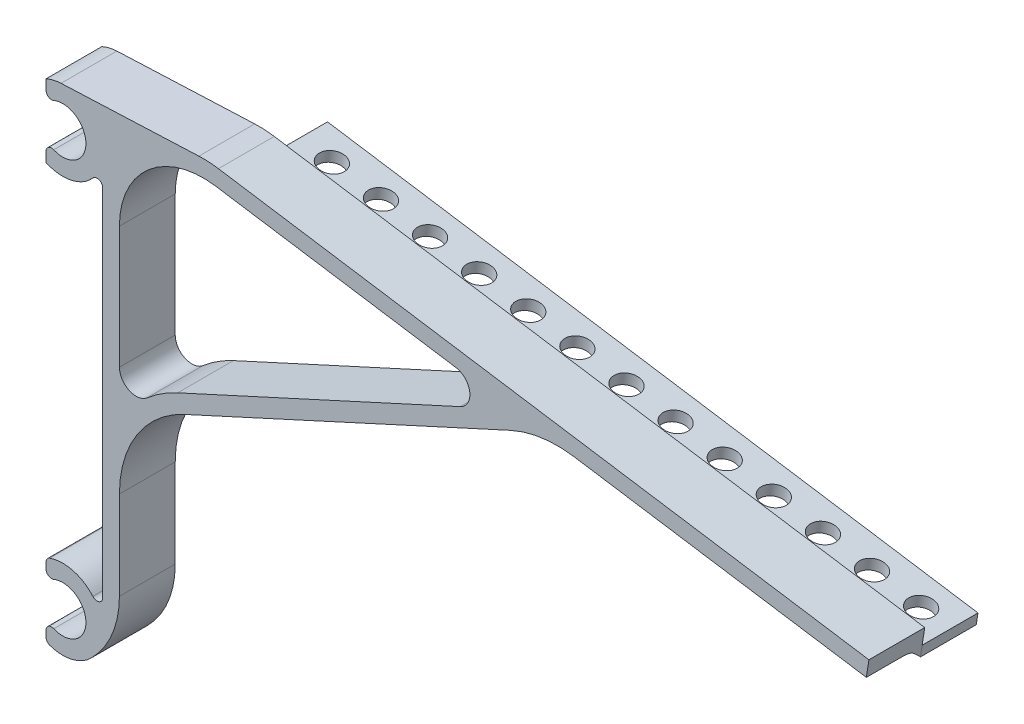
ISO-10303-21;
HEADER;
FILE_DESCRIPTION(('STEP AP214'),'2;1');
FILE_NAME('part.step','',(''),(''),'','','');
FILE_SCHEMA(('AUTOMOTIVE_DESIGN { 1 0 10303 214 1 1 1 1 }'));
ENDSEC;
DATA;
#1=APPLICATION_CONTEXT('core data for automotive mechanical design processes');
#2=APPLICATION_PROTOCOL_DEFINITION('international standard','automotive_design',2000,#1);
#3=PRODUCT_CONTEXT('',#1,'mechanical');
#4=PRODUCT('Part','Part','',(#3));
#5=PRODUCT_RELATED_PRODUCT_CATEGORY('part','',(#4));
#6=PRODUCT_DEFINITION_FORMATION('','',#4);
#7=PRODUCT_DEFINITION_CONTEXT('part definition',#1,'design');
#8=PRODUCT_DEFINITION('design','',#6,#7);
#9=PRODUCT_DEFINITION_SHAPE('','',#8);
#10=(LENGTH_UNIT() NAMED_UNIT(*) SI_UNIT(.MILLI.,.METRE.));
#11=(NAMED_UNIT(*) PLANE_ANGLE_UNIT() SI_UNIT($,.RADIAN.));
#12=(NAMED_UNIT(*) SI_UNIT($,.STERADIAN.) SOLID_ANGLE_UNIT());
#13=UNCERTAINTY_MEASURE_WITH_UNIT(LENGTH_MEASURE(1.E-05),#10,'distance_accuracy_value','');
#14=(GEOMETRIC_REPRESENTATION_CONTEXT(3) GLOBAL_UNCERTAINTY_ASSIGNED_CONTEXT((#13)) GLOBAL_UNIT_ASSIGNED_CONTEXT((#10,
#11,#12)) REPRESENTATION_CONTEXT('',''));
#15=CARTESIAN_POINT('',(0.,0.,0.));
#16=DIRECTION('',(0.,0.,1.));
#17=DIRECTION('',(1.,0.,0.));
#18=AXIS2_PLACEMENT_3D('',#15,#16,#17);
#19=CARTESIAN_POINT('',(18.3610940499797,76.6557520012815,10.));
#20=DIRECTION('',(-1.,0.,0.));
#21=DIRECTION('',(0.,-1.,0.));
#22=AXIS2_PLACEMENT_3D('',#19,#20,#21);
#23=PLANE('',#22);
#24=DIRECTION('',(0.,1.,0.));
#25=VECTOR('',#24,1.);
#26=CARTESIAN_POINT('',(18.3610940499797,76.6557520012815,10.));
#27=LINE('',#26,#25);
#28=CARTESIAN_POINT('',(18.3610940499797,54.7732539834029,10.));
#29=VERTEX_POINT('',#28);
#30=CARTESIAN_POINT('',(18.3610940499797,76.6557520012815,10.));
#31=VERTEX_POINT('',#30);
#32=EDGE_CURVE('E641',#29,#31,#27,.T.);
#33=ORIENTED_EDGE('',*,*,#32,.F.);
#34=DIRECTION('',(0.,0.,1.));
#35=VECTOR('',#34,1.);
#36=CARTESIAN_POINT('',(18.3610940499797,54.7732539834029,0.));
#37=LINE('',#36,#35);
#38=CARTESIAN_POINT('',(18.3610940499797,54.7732539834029,0.));
#39=VERTEX_POINT('',#38);
#40=EDGE_CURVE('E698',#29,#39,#37,.F.);
#41=ORIENTED_EDGE('',*,*,#40,.T.);
#42=DIRECTION('',(0.,1.,0.));
#43=VECTOR('',#42,1.);
#44=CARTESIAN_POINT('',(18.3610940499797,76.6557520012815,0.));
#45=LINE('',#44,#43);
#46=CARTESIAN_POINT('',(18.3610940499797,76.6557520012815,0.));
#47=VERTEX_POINT('',#46);
#48=EDGE_CURVE('E390',#39,#47,#45,.T.);
#49=ORIENTED_EDGE('',*,*,#48,.T.);
#50=DIRECTION('',(0.,0.,-1.));
#51=VECTOR('',#50,1.);
#52=CARTESIAN_POINT('',(18.3610940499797,76.6557520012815,10.));
#53=LINE('',#52,#51);
#54=EDGE_CURVE('E385',#31,#47,#53,.T.);
#55=ORIENTED_EDGE('',*,*,#54,.F.);
#56=EDGE_LOOP('',(#33,#41,#49,#55));
#57=FACE_BOUND('',#56,.T.);
#58=ADVANCED_FACE('F38',(#57),#23,.F.);
#59=DIRECTION('',(0.,0.,-1.));
#60=VECTOR('',#59,1.);
#61=CARTESIAN_POINT('',(18.3610940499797,35.1009384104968,10.));
#62=LINE('',#61,#60);
#63=CARTESIAN_POINT('',(18.3610940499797,35.1009384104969,10.));
#64=VERTEX_POINT('',#63);
#65=CARTESIAN_POINT('',(18.3610940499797,35.1009384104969,0.));
#66=VERTEX_POINT('',#65);
#67=EDGE_CURVE('E630',#64,#66,#62,.T.);
#68=ORIENTED_EDGE('',*,*,#67,.F.);
#69=CARTESIAN_POINT('',(18.3610940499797,19.2292377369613,10.));
#70=VERTEX_POINT('',#69);
#71=EDGE_CURVE('E642',#70,#64,#27,.T.);
#72=ORIENTED_EDGE('',*,*,#71,.F.);
#73=DIRECTION('',(0.,0.,-1.));
#74=VECTOR('',#73,1.);
#75=CARTESIAN_POINT('',(18.3610940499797,19.2292377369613,10.));
#76=LINE('',#75,#74);
#77=CARTESIAN_POINT('',(18.3610940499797,19.2292377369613,0.));
#78=VERTEX_POINT('',#77);
#79=EDGE_CURVE('E875',#70,#78,#76,.T.);
#80=ORIENTED_EDGE('',*,*,#79,.T.);
#81=EDGE_CURVE('E386',#78,#66,#45,.T.);
#82=ORIENTED_EDGE('',*,*,#81,.T.);
#83=EDGE_LOOP('',(#68,#72,#80,#82));
#84=FACE_BOUND('',#83,.T.);
#85=ADVANCED_FACE('F938',(#84),#23,.F.);
#86=CARTESIAN_POINT('',(152.168484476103,73.5541685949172,10.));
#87=DIRECTION('',(0.152057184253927,0.988371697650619,0.));
#88=DIRECTION('',(-0.988371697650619,0.152057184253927,0.));
#89=AXIS2_PLACEMENT_3D('',#86,#87,#88);
#90=PLANE('',#89);
#91=DIRECTION('',(0.,0.,-1.));
#92=VECTOR('',#91,1.);
#93=CARTESIAN_POINT('',(99.8242497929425,81.60712777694,10.));
#94=LINE('',#93,#92);
#95=CARTESIAN_POINT('',(99.8242497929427,81.6071277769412,10.));
#96=VERTEX_POINT('',#95);
#97=CARTESIAN_POINT('',(99.8242497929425,81.60712777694,3.2426406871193));
#98=VERTEX_POINT('',#97);
#99=EDGE_CURVE('E618',#96,#98,#94,.T.);
#100=ORIENTED_EDGE('',*,*,#99,.T.);
#101=DIRECTION('',(0.988371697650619,-0.152057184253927,0.));
#102=VECTOR('',#101,1.);
#103=CARTESIAN_POINT('',(152.168484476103,73.5541685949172,3.2426406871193));
#104=LINE('',#103,#102);
#105=CARTESIAN_POINT('',(152.168484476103,73.5541685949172,3.2426406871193));
#106=VERTEX_POINT('',#105);
#107=EDGE_CURVE('E592',#98,#106,#104,.T.);
#108=ORIENTED_EDGE('',*,*,#107,.T.);
#109=DIRECTION('',(0.,0.,-1.));
#110=VECTOR('',#109,1.);
#111=CARTESIAN_POINT('',(152.168484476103,73.5541685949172,10.));
#112=LINE('',#111,#110);
#113=CARTESIAN_POINT('',(152.168484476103,73.5541685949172,10.));
#114=VERTEX_POINT('',#113);
#115=EDGE_CURVE('E869',#114,#106,#112,.T.);
#116=ORIENTED_EDGE('',*,*,#115,.F.);
#117=DIRECTION('',(0.988371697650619,-0.152057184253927,0.));
#118=VECTOR('',#117,1.);
#119=CARTESIAN_POINT('',(152.168484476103,73.5541685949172,10.));
#120=LINE('',#119,#118);
#121=EDGE_CURVE('E622',#96,#114,#120,.T.);
#122=ORIENTED_EDGE('',*,*,#121,.F.);
#123=EDGE_LOOP('',(#100,#108,#116,#122));
#124=FACE_BOUND('',#123,.T.);
#125=ADVANCED_FACE('F620',(#124),#90,.F.);
#126=DIRECTION('',(0.,0.,-1.));
#127=VECTOR('',#126,1.);
#128=CARTESIAN_POINT('',(35.6419518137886,91.4813274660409,10.));
#129=LINE('',#128,#127);
#130=CARTESIAN_POINT('',(35.6419518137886,91.4813274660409,10.));
#131=VERTEX_POINT('',#130);
#132=CARTESIAN_POINT('',(35.6419518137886,91.4813274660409,3.24264068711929));
#133=VERTEX_POINT('',#132);
#134=EDGE_CURVE('E871',#131,#133,#129,.T.);
#135=ORIENTED_EDGE('',*,*,#134,.T.);
#136=DIRECTION('',(0.988371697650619,-0.152057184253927,0.));
#137=VECTOR('',#136,1.);
#138=CARTESIAN_POINT('',(78.6076659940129,84.8712175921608,3.24264068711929));
#139=LINE('',#138,#137);
#140=CARTESIAN_POINT('',(78.6076659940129,84.8712175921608,3.24264068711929));
#141=VERTEX_POINT('',#140);
#142=EDGE_CURVE('E596',#133,#141,#139,.T.);
#143=ORIENTED_EDGE('',*,*,#142,.T.);
#144=DIRECTION('',(0.,0.,-1.));
#145=VECTOR('',#144,1.);
#146=CARTESIAN_POINT('',(78.6076659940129,84.8712175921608,10.));
#147=LINE('',#146,#145);
#148=CARTESIAN_POINT('',(78.6076659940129,84.8712175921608,10.));
#149=VERTEX_POINT('',#148);
#150=EDGE_CURVE('E884',#141,#149,#147,.F.);
#151=ORIENTED_EDGE('',*,*,#150,.T.);
#152=EDGE_CURVE('E647',#131,#149,#120,.T.);
#153=ORIENTED_EDGE('',*,*,#152,.F.);
#154=EDGE_LOOP('',(#135,#143,#151,#153));
#155=FACE_BOUND('',#154,.T.);
#156=ADVANCED_FACE('F1065',(#155),#90,.F.);
#157=CARTESIAN_POINT('',(8.21109404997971,12.15,10.));
#158=DIRECTION('',(0.,0.,-1.));
#159=DIRECTION('',(-1.,0.,0.));
#160=AXIS2_PLACEMENT_3D('',#157,#158,#159);
#161=CYLINDRICAL_SURFACE('',#160,7.14999999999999);
#162=CARTESIAN_POINT('',(8.21109404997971,12.15,10.));
#163=DIRECTION('',(0.,0.,1.));
#164=DIRECTION('',(1.,0.,0.));
#165=AXIS2_PLACEMENT_3D('',#162,#163,#164);
#166=CIRCLE('',#165,7.14999999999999);
#167=CARTESIAN_POINT('',(5.88589079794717,5.38864437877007,10.));
#168=VERTEX_POINT('',#167);
#169=CARTESIAN_POINT('',(13.2477935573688,7.07514452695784,10.));
#170=VERTEX_POINT('',#169);
#171=EDGE_CURVE('E634',#168,#170,#166,.T.);
#172=ORIENTED_EDGE('',*,*,#171,.F.);
#173=DIRECTION('',(0.,0.,-1.));
#174=VECTOR('',#173,1.);
#175=CARTESIAN_POINT('',(5.88589079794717,5.38864437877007,10.));
#176=LINE('',#175,#174);
#177=CARTESIAN_POINT('',(5.88589079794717,5.38864437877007,0.));
#178=VERTEX_POINT('',#177);
#179=EDGE_CURVE('E708',#168,#178,#176,.T.);
#180=ORIENTED_EDGE('',*,*,#179,.T.);
#181=CARTESIAN_POINT('',(8.21109404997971,12.15,0.));
#182=DIRECTION('',(0.,0.,1.));
#183=DIRECTION('',(1.,0.,0.));
#184=AXIS2_PLACEMENT_3D('',#181,#182,#183);
#185=CIRCLE('',#184,7.14999999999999);
#186=CARTESIAN_POINT('',(13.2477935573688,7.07514452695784,0.));
#187=VERTEX_POINT('',#186);
#188=EDGE_CURVE('E624',#178,#187,#185,.T.);
#189=ORIENTED_EDGE('',*,*,#188,.T.);
#190=DIRECTION('',(0.,0.,-1.));
#191=VECTOR('',#190,1.);
#192=CARTESIAN_POINT('',(13.2477935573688,7.07514452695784,10.));
#193=LINE('',#192,#191);
#194=EDGE_CURVE('E879',#170,#187,#193,.T.);
#195=ORIENTED_EDGE('',*,*,#194,.F.);
#196=EDGE_LOOP('',(#172,#180,#189,#195));
#197=FACE_BOUND('',#196,.T.);
#198=ADVANCED_FACE('F949',(#197),#161,.T.);
#199=CARTESIAN_POINT('',(13.3364635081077,7.16314780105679,10.));
#200=DIRECTION('',(-0.704433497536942,0.709769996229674,0.));
#201=DIRECTION('',(-0.709769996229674,-0.704433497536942,0.));
#202=AXIS2_PLACEMENT_3D('',#199,#200,#201);
#203=PLANE('',#202);
#204=DIRECTION('',(0.709769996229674,0.704433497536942,0.));
#205=VECTOR('',#204,1.);
#206=CARTESIAN_POINT('',(13.3364635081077,7.16314780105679,0.));
#207=LINE('',#206,#205);
#208=CARTESIAN_POINT('',(13.3364635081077,7.16314780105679,0.));
#209=VERTEX_POINT('',#208);
#210=EDGE_CURVE('E627',#187,#209,#207,.T.);
#211=ORIENTED_EDGE('',*,*,#210,.T.);
#212=DIRECTION('',(0.,0.,-1.));
#213=VECTOR('',#212,1.);
#214=CARTESIAN_POINT('',(13.3364635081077,7.16314780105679,10.));
#215=LINE('',#214,#213);
#216=CARTESIAN_POINT('',(13.3364635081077,7.16314780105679,10.));
#217=VERTEX_POINT('',#216);
#218=EDGE_CURVE('E877',#217,#209,#215,.T.);
#219=ORIENTED_EDGE('',*,*,#218,.F.);
#220=DIRECTION('',(0.709769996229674,0.704433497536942,0.));
#221=VECTOR('',#220,1.);
#222=CARTESIAN_POINT('',(13.3364635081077,7.16314780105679,10.));
#223=LINE('',#222,#221);
#224=EDGE_CURVE('E636',#170,#217,#223,.T.);
#225=ORIENTED_EDGE('',*,*,#224,.F.);
#226=ORIENTED_EDGE('',*,*,#194,.T.);
#227=EDGE_LOOP('',(#211,#219,#225,#226));
#228=FACE_BOUND('',#227,.T.);
#229=ADVANCED_FACE('F946',(#228),#203,.F.);
#230=CARTESIAN_POINT('',(1.36109404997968,19.2292377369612,10.));
#231=DIRECTION('',(0.,0.,-1.));
#232=DIRECTION('',(-1.,0.,0.));
#233=AXIS2_PLACEMENT_3D('',#230,#231,#232);
#234=CYLINDRICAL_SURFACE('',#233,17.);
#235=CARTESIAN_POINT('',(1.36109404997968,19.2292377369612,0.));
#236=DIRECTION('',(0.,0.,1.));
#237=DIRECTION('',(-1.,0.,0.));
#238=AXIS2_PLACEMENT_3D('',#235,#236,#237);
#239=CIRCLE('',#238,17.);
#240=EDGE_CURVE('E689',#209,#78,#239,.T.);
#241=ORIENTED_EDGE('',*,*,#240,.T.);
#242=ORIENTED_EDGE('',*,*,#79,.F.);
#243=CARTESIAN_POINT('',(1.36109404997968,19.2292377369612,10.));
#244=DIRECTION('',(0.,0.,1.));
#245=DIRECTION('',(-1.,0.,0.));
#246=AXIS2_PLACEMENT_3D('',#243,#244,#245);
#247=CIRCLE('',#246,17.);
#248=EDGE_CURVE('E639',#217,#70,#247,.T.);
#249=ORIENTED_EDGE('',*,*,#248,.F.);
#250=ORIENTED_EDGE('',*,*,#218,.T.);
#251=EDGE_LOOP('',(#241,#242,#249,#250));
#252=FACE_BOUND('',#251,.T.);
#253=ADVANCED_FACE('F939',(#252),#234,.T.);
#254=CARTESIAN_POINT('',(33.3610940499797,76.6557520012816,10.));
#255=DIRECTION('',(0.,0.,-1.));
#256=DIRECTION('',(-1.,0.,0.));
#257=AXIS2_PLACEMENT_3D('',#254,#255,#256);
#258=CYLINDRICAL_SURFACE('',#257,15.);
#259=DIRECTION('',(0.,0.,-1.));
#260=VECTOR('',#259,1.);
#261=CARTESIAN_POINT('',(35.6418678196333,91.481340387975,0.));
#262=LINE('',#261,#260);
#263=CARTESIAN_POINT('',(35.6418678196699,91.481340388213,0.));
#264=VERTEX_POINT('',#263);
#265=CARTESIAN_POINT('',(35.6418678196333,91.481340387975,3.24264068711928));
#266=VERTEX_POINT('',#265);
#267=EDGE_CURVE('E370',#264,#266,#262,.F.);
#268=ORIENTED_EDGE('',*,*,#267,.T.);
#269=CARTESIAN_POINT('',(33.3610940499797,76.6557520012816,3.24264068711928));
#270=DIRECTION('',(0.,0.,-1.));
#271=DIRECTION('',(-1.,0.,0.));
#272=AXIS2_PLACEMENT_3D('',#269,#270,#271);
#273=CIRCLE('',#272,15.);
#274=EDGE_CURVE('E583',#266,#133,#273,.T.);
#275=ORIENTED_EDGE('',*,*,#274,.T.);
#276=ORIENTED_EDGE('',*,*,#134,.F.);
#277=CARTESIAN_POINT('',(33.3610940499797,76.6557520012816,10.));
#278=DIRECTION('',(0.,0.,-1.));
#279=DIRECTION('',(1.,0.,0.));
#280=AXIS2_PLACEMENT_3D('',#277,#278,#279);
#281=CIRCLE('',#280,15.);
#282=EDGE_CURVE('E645',#31,#131,#281,.T.);
#283=ORIENTED_EDGE('',*,*,#282,.F.);
#284=ORIENTED_EDGE('',*,*,#54,.T.);
#285=CARTESIAN_POINT('',(33.3610940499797,76.6557520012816,0.));
#286=DIRECTION('',(0.,0.,-1.));
#287=DIRECTION('',(1.,0.,0.));
#288=AXIS2_PLACEMENT_3D('',#285,#286,#287);
#289=CIRCLE('',#288,15.);
#290=EDGE_CURVE('E355',#47,#264,#289,.T.);
#291=ORIENTED_EDGE('',*,*,#290,.T.);
#292=EDGE_LOOP('',(#268,#275,#276,#283,#284,#291));
#293=FACE_BOUND('',#292,.T.);
#294=ADVANCED_FACE('F382',(#293),#258,.F.);
#295=CARTESIAN_POINT('',(152.624824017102,76.5192578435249,10.));
#296=DIRECTION('',(-0.988363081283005,0.152113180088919,0.));
#297=DIRECTION('',(-0.152113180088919,-0.988363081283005,0.));
#298=AXIS2_PLACEMENT_3D('',#295,#296,#297);
#299=PLANE('',#298);
#300=DIRECTION('',(0.152113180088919,0.988363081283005,0.));
#301=VECTOR('',#300,1.);
#302=CARTESIAN_POINT('',(152.624824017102,76.5192578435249,0.));
#303=LINE('',#302,#301);
#304=CARTESIAN_POINT('',(151.864258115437,71.5774424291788,0.));
#305=VERTEX_POINT('',#304);
#306=CARTESIAN_POINT('',(152.168526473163,73.5541621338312,0.));
#307=VERTEX_POINT('',#306);
#308=EDGE_CURVE('E388',#305,#307,#303,.T.);
#309=ORIENTED_EDGE('',*,*,#308,.T.);
#310=CARTESIAN_POINT('',(152.624824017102,76.5192578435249,0.));
#311=VERTEX_POINT('',#310);
#312=EDGE_CURVE('E357',#307,#311,#303,.T.);
#313=ORIENTED_EDGE('',*,*,#312,.T.);
#314=DIRECTION('',(0.,0.,-1.));
#315=VECTOR('',#314,1.);
#316=CARTESIAN_POINT('',(152.624824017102,76.5192578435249,10.));
#317=LINE('',#316,#315);
#318=CARTESIAN_POINT('',(152.624824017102,76.5192578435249,10.));
#319=VERTEX_POINT('',#318);
#320=EDGE_CURVE('E867',#319,#311,#317,.T.);
#321=ORIENTED_EDGE('',*,*,#320,.F.);
#322=DIRECTION('',(0.152113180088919,0.988363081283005,0.));
#323=VECTOR('',#322,1.);
#324=CARTESIAN_POINT('',(152.624824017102,76.5192578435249,10.));
#325=LINE('',#324,#323);
#326=EDGE_CURVE('E650',#114,#319,#325,.T.);
#327=ORIENTED_EDGE('',*,*,#326,.F.);
#328=ORIENTED_EDGE('',*,*,#115,.T.);
#329=CARTESIAN_POINT('',(151.712144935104,70.5890793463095,3.2426406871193));
#330=DIRECTION('',(-0.988363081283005,0.152113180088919,0.));
#331=DIRECTION('',(-0.152113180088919,-0.988363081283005,-4.18161084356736E-13));
#332=AXIS2_PLACEMENT_3D('',#329,#330,#331);
#333=ELLIPSE('',#332,3.00000000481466,3.);
#334=CARTESIAN_POINT('',(152.034825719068,72.6857140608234,1.12132034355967));
#335=VERTEX_POINT('',#334);
#336=EDGE_CURVE('E11',#106,#335,#333,.T.);
#337=ORIENTED_EDGE('',*,*,#336,.T.);
#338=DIRECTION('',(-0.107560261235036,-0.698878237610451,-0.707106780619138));
#339=VECTOR('',#338,1.);
#340=CARTESIAN_POINT('',(153.005106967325,78.9901655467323,7.49999999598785));
#341=LINE('',#340,#339);
#342=EDGE_CURVE('E569',#335,#305,#341,.T.);
#343=ORIENTED_EDGE('',*,*,#342,.T.);
#344=EDGE_LOOP('',(#309,#313,#321,#327,#328,#337,#343));
#345=FACE_BOUND('',#344,.T.);
#346=ADVANCED_FACE('F800',(#345),#299,.F.);
#347=CARTESIAN_POINT('',(36.0981233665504,94.4464425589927,10.));
#348=DIRECTION('',(-0.152057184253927,-0.988371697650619,0.));
#349=DIRECTION('',(0.988371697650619,-0.152057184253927,0.));
#350=AXIS2_PLACEMENT_3D('',#347,#348,#349);
#351=PLANE('',#350);
#352=DIRECTION('',(-0.988371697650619,0.152057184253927,0.));
#353=VECTOR('',#352,1.);
#354=CARTESIAN_POINT('',(36.0981233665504,94.4464425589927,0.));
#355=LINE('',#354,#353);
#356=CARTESIAN_POINT('',(36.0981233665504,94.4464425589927,0.));
#357=VERTEX_POINT('',#356);
#358=EDGE_CURVE('E396',#311,#357,#355,.T.);
#359=ORIENTED_EDGE('',*,*,#358,.T.);
#360=DIRECTION('',(0.,0.,-1.));
#361=VECTOR('',#360,1.);
#362=CARTESIAN_POINT('',(36.0981233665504,94.4464425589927,10.));
#363=LINE('',#362,#361);
#364=CARTESIAN_POINT('',(36.0981233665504,94.4464425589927,10.));
#365=VERTEX_POINT('',#364);
#366=EDGE_CURVE('E865',#365,#357,#363,.T.);
#367=ORIENTED_EDGE('',*,*,#366,.F.);
#368=DIRECTION('',(-0.988371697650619,0.152057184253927,0.));
#369=VECTOR('',#368,1.);
#370=CARTESIAN_POINT('',(36.0981233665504,94.4464425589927,10.));
#371=LINE('',#370,#369);
#372=EDGE_CURVE('E652',#319,#365,#371,.T.);
#373=ORIENTED_EDGE('',*,*,#372,.F.);
#374=ORIENTED_EDGE('',*,*,#320,.T.);
#375=EDGE_LOOP('',(#359,#367,#373,#374));
#376=FACE_BOUND('',#375,.T.);
#377=ADVANCED_FACE('F1042',(#376),#351,.F.);
#378=CARTESIAN_POINT('',(33.3610940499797,76.6557520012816,10.));
#379=DIRECTION('',(0.,0.,-1.));
#380=DIRECTION('',(-1.,0.,0.));
#381=AXIS2_PLACEMENT_3D('',#378,#379,#380);
#382=CYLINDRICAL_SURFACE('',#381,18.);
#383=CARTESIAN_POINT('',(33.3610940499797,76.6557520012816,0.));
#384=DIRECTION('',(0.,0.,1.));
#385=DIRECTION('',(1.,0.,0.));
#386=AXIS2_PLACEMENT_3D('',#383,#384,#385);
#387=CIRCLE('',#386,18.);
#388=CARTESIAN_POINT('',(32.5978857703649,94.6395645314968,0.));
#389=VERTEX_POINT('',#388);
#390=EDGE_CURVE('E803',#357,#389,#387,.T.);
#391=ORIENTED_EDGE('',*,*,#390,.T.);
#392=DIRECTION('',(0.,0.,-1.));
#393=VECTOR('',#392,1.);
#394=CARTESIAN_POINT('',(32.5978857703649,94.6395645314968,10.));
#395=LINE('',#394,#393);
#396=CARTESIAN_POINT('',(32.5978857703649,94.6395645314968,10.));
#397=VERTEX_POINT('',#396);
#398=EDGE_CURVE('E863',#397,#389,#395,.T.);
#399=ORIENTED_EDGE('',*,*,#398,.F.);
#400=CARTESIAN_POINT('',(33.3610940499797,76.6557520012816,10.));
#401=DIRECTION('',(0.,0.,1.));
#402=DIRECTION('',(1.,0.,0.));
#403=AXIS2_PLACEMENT_3D('',#400,#401,#402);
#404=CIRCLE('',#403,18.);
#405=EDGE_CURVE('E654',#365,#397,#404,.T.);
#406=ORIENTED_EDGE('',*,*,#405,.F.);
#407=ORIENTED_EDGE('',*,*,#366,.T.);
#408=EDGE_LOOP('',(#391,#399,#406,#407));
#409=FACE_BOUND('',#408,.T.);
#410=ADVANCED_FACE('F1039',(#409),#382,.T.);
#411=CARTESIAN_POINT('',(7.90793076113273,93.5917567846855,10.));
#412=DIRECTION('',(0.0424004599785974,-0.99910069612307,0.));
#413=DIRECTION('',(0.99910069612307,0.0424004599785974,0.));
#414=AXIS2_PLACEMENT_3D('',#411,#412,#413);
#415=PLANE('',#414);
#416=DIRECTION('',(-0.99910069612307,-0.0424004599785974,0.));
#417=VECTOR('',#416,1.);
#418=CARTESIAN_POINT('',(7.90793076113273,93.5917567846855,0.));
#419=LINE('',#418,#417);
#420=CARTESIAN_POINT('',(7.90793076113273,93.5917567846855,0.));
#421=VERTEX_POINT('',#420);
#422=EDGE_CURVE('E807',#389,#421,#419,.T.);
#423=ORIENTED_EDGE('',*,*,#422,.T.);
#424=DIRECTION('',(0.,0.,-1.));
#425=VECTOR('',#424,1.);
#426=CARTESIAN_POINT('',(7.90793076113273,93.5917567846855,10.));
#427=LINE('',#426,#425);
#428=CARTESIAN_POINT('',(7.90793076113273,93.5917567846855,10.));
#429=VERTEX_POINT('',#428);
#430=EDGE_CURVE('E860',#429,#421,#427,.T.);
#431=ORIENTED_EDGE('',*,*,#430,.F.);
#432=DIRECTION('',(-0.99910069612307,-0.0424004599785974,0.));
#433=VECTOR('',#432,1.);
#434=CARTESIAN_POINT('',(7.90793076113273,93.5917567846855,10.));
#435=LINE('',#434,#433);
#436=EDGE_CURVE('E656',#397,#429,#435,.T.);
#437=ORIENTED_EDGE('',*,*,#436,.F.);
#438=ORIENTED_EDGE('',*,*,#398,.T.);
#439=EDGE_LOOP('',(#423,#431,#437,#438));
#440=FACE_BOUND('',#439,.T.);
#441=ADVANCED_FACE('F1036',(#440),#415,.F.);
#442=CARTESIAN_POINT('',(8.2110940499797,86.4481868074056,10.));
#443=DIRECTION('',(0.,0.,-1.));
#444=DIRECTION('',(-1.,0.,0.));
#445=AXIS2_PLACEMENT_3D('',#442,#443,#444);
#446=CYLINDRICAL_SURFACE('',#445,7.14999999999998);
#447=CARTESIAN_POINT('',(8.2110940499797,86.4481868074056,0.));
#448=DIRECTION('',(0.,0.,1.));
#449=DIRECTION('',(1.,0.,0.));
#450=AXIS2_PLACEMENT_3D('',#447,#448,#449);
#451=CIRCLE('',#450,7.14999999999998);
#452=CARTESIAN_POINT('',(5.21109404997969,92.9383717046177,0.));
#453=VERTEX_POINT('',#452);
#454=EDGE_CURVE('E812',#421,#453,#451,.T.);
#455=ORIENTED_EDGE('',*,*,#454,.T.);
#456=DIRECTION('',(0.,0.,-1.));
#457=VECTOR('',#456,1.);
#458=CARTESIAN_POINT('',(5.21109404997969,92.9383717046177,10.));
#459=LINE('',#458,#457);
#460=CARTESIAN_POINT('',(5.21109404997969,92.9383717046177,10.));
#461=VERTEX_POINT('',#460);
#462=EDGE_CURVE('E857',#461,#453,#459,.T.);
#463=ORIENTED_EDGE('',*,*,#462,.F.);
#464=CARTESIAN_POINT('',(8.2110940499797,86.4481868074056,10.));
#465=DIRECTION('',(0.,0.,1.));
#466=DIRECTION('',(1.,0.,0.));
#467=AXIS2_PLACEMENT_3D('',#464,#465,#466);
#468=CIRCLE('',#467,7.14999999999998);
#469=EDGE_CURVE('E658',#429,#461,#468,.T.);
#470=ORIENTED_EDGE('',*,*,#469,.F.);
#471=ORIENTED_EDGE('',*,*,#430,.T.);
#472=EDGE_LOOP('',(#455,#463,#470,#471));
#473=FACE_BOUND('',#472,.T.);
#474=ADVANCED_FACE('F1032',(#473),#446,.T.);
#475=CARTESIAN_POINT('',(5.21109404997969,92.9383717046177,10.));
#476=DIRECTION('',(1.,0.,0.));
#477=DIRECTION('',(0.,1.,0.));
#478=AXIS2_PLACEMENT_3D('',#475,#476,#477);
#479=PLANE('',#478);
#480=DIRECTION('',(0.,-1.,0.));
#481=VECTOR('',#480,1.);
#482=CARTESIAN_POINT('',(5.21109404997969,92.9383717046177,0.));
#483=LINE('',#482,#481);
#484=CARTESIAN_POINT('',(5.21109404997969,91.1939744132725,0.));
#485=VERTEX_POINT('',#484);
#486=EDGE_CURVE('E816',#453,#485,#483,.T.);
#487=ORIENTED_EDGE('',*,*,#486,.T.);
#488=DIRECTION('',(0.,0.,-1.));
#489=VECTOR('',#488,1.);
#490=CARTESIAN_POINT('',(5.21109404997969,91.1939744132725,10.));
#491=LINE('',#490,#489);
#492=CARTESIAN_POINT('',(5.21109404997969,91.1939744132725,10.));
#493=VERTEX_POINT('',#492);
#494=EDGE_CURVE('E763',#485,#493,#491,.F.);
#495=ORIENTED_EDGE('',*,*,#494,.T.);
#496=DIRECTION('',(0.,-1.,0.));
#497=VECTOR('',#496,1.);
#498=CARTESIAN_POINT('',(5.21109404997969,92.9383717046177,10.));
#499=LINE('',#498,#497);
#500=EDGE_CURVE('E660',#461,#493,#499,.T.);
#501=ORIENTED_EDGE('',*,*,#500,.F.);
#502=ORIENTED_EDGE('',*,*,#462,.T.);
#503=EDGE_LOOP('',(#487,#495,#501,#502));
#504=FACE_BOUND('',#503,.T.);
#505=ADVANCED_FACE('F1028',(#504),#479,.F.);
#506=CARTESIAN_POINT('',(8.2110940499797,86.4481868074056,10.));
#507=DIRECTION('',(0.,0.,-1.));
#508=DIRECTION('',(-1.,0.,0.));
#509=AXIS2_PLACEMENT_3D('',#506,#507,#508);
#510=CYLINDRICAL_SURFACE('',#509,4.14999999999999);
#511=CARTESIAN_POINT('',(8.2110940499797,86.4481868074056,10.));
#512=DIRECTION('',(0.,0.,-1.));
#513=DIRECTION('',(1.,0.,0.));
#514=AXIS2_PLACEMENT_3D('',#511,#512,#513);
#515=CIRCLE('',#514,4.14999999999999);
#516=CARTESIAN_POINT('',(6.5994435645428,90.2724622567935,10.));
#517=VERTEX_POINT('',#516);
#518=CARTESIAN_POINT('',(6.59944356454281,82.6239113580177,10.));
#519=VERTEX_POINT('',#518);
#520=EDGE_CURVE('E663',#517,#519,#515,.T.);
#521=ORIENTED_EDGE('',*,*,#520,.F.);
#522=DIRECTION('',(0.,0.,-1.));
#523=VECTOR('',#522,1.);
#524=CARTESIAN_POINT('',(6.5994435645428,90.2724622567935,10.));
#525=LINE('',#524,#523);
#526=CARTESIAN_POINT('',(6.5994435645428,90.2724622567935,0.));
#527=VERTEX_POINT('',#526);
#528=EDGE_CURVE('E760',#517,#527,#525,.T.);
#529=ORIENTED_EDGE('',*,*,#528,.T.);
#530=CARTESIAN_POINT('',(8.2110940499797,86.4481868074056,0.));
#531=DIRECTION('',(0.,0.,-1.));
#532=DIRECTION('',(1.,0.,0.));
#533=AXIS2_PLACEMENT_3D('',#530,#531,#532);
#534=CIRCLE('',#533,4.14999999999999);
#535=CARTESIAN_POINT('',(6.59944356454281,82.6239113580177,0.));
#536=VERTEX_POINT('',#535);
#537=EDGE_CURVE('E819',#527,#536,#534,.T.);
#538=ORIENTED_EDGE('',*,*,#537,.T.);
#539=DIRECTION('',(0.,0.,-1.));
#540=VECTOR('',#539,1.);
#541=CARTESIAN_POINT('',(6.5994435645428,82.6239113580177,10.));
#542=LINE('',#541,#540);
#543=EDGE_CURVE('E758',#536,#519,#542,.F.);
#544=ORIENTED_EDGE('',*,*,#543,.T.);
#545=EDGE_LOOP('',(#521,#529,#538,#544));
#546=FACE_BOUND('',#545,.T.);
#547=ADVANCED_FACE('F1018',(#546),#510,.F.);
#548=CARTESIAN_POINT('',(5.21109404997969,83.5806966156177,10.));
#549=DIRECTION('',(1.,0.,0.));
#550=DIRECTION('',(0.,0.,-1.));
#551=AXIS2_PLACEMENT_3D('',#548,#549,#550);
#552=PLANE('',#551);
#553=DIRECTION('',(0.,-1.,0.));
#554=VECTOR('',#553,1.);
#555=CARTESIAN_POINT('',(5.21109404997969,83.5806966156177,10.));
#556=LINE('',#555,#554);
#557=CARTESIAN_POINT('',(5.21109404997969,81.7023992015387,10.));
#558=VERTEX_POINT('',#557);
#559=CARTESIAN_POINT('',(5.2110940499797,79.9580019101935,10.));
#560=VERTEX_POINT('',#559);
#561=EDGE_CURVE('E666',#558,#560,#556,.T.);
#562=ORIENTED_EDGE('',*,*,#561,.F.);
#563=DIRECTION('',(0.,0.,-1.));
#564=VECTOR('',#563,1.);
#565=CARTESIAN_POINT('',(5.21109404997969,81.7023992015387,10.));
#566=LINE('',#565,#564);
#567=CARTESIAN_POINT('',(5.21109404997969,81.7023992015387,0.));
#568=VERTEX_POINT('',#567);
#569=EDGE_CURVE('E379',#558,#568,#566,.T.);
#570=ORIENTED_EDGE('',*,*,#569,.T.);
#571=DIRECTION('',(0.,-1.,0.));
#572=VECTOR('',#571,1.);
#573=CARTESIAN_POINT('',(5.21109404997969,83.5806966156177,0.));
#574=LINE('',#573,#572);
#575=CARTESIAN_POINT('',(5.2110940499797,79.9580019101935,0.));
#576=VERTEX_POINT('',#575);
#577=EDGE_CURVE('E822',#568,#576,#574,.T.);
#578=ORIENTED_EDGE('',*,*,#577,.T.);
#579=DIRECTION('',(0.,0.,-1.));
#580=VECTOR('',#579,1.);
#581=CARTESIAN_POINT('',(5.2110940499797,79.9580019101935,10.));
#582=LINE('',#581,#580);
#583=EDGE_CURVE('E854',#560,#576,#582,.T.);
#584=ORIENTED_EDGE('',*,*,#583,.F.);
#585=EDGE_LOOP('',(#562,#570,#578,#584));
#586=FACE_BOUND('',#585,.T.);
#587=ADVANCED_FACE('F1011',(#586),#552,.F.);
#588=CARTESIAN_POINT('',(8.2110940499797,86.4481868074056,10.));
#589=DIRECTION('',(0.,0.,-1.));
#590=DIRECTION('',(-1.,0.,0.));
#591=AXIS2_PLACEMENT_3D('',#588,#589,#590);
#592=CYLINDRICAL_SURFACE('',#591,7.14999999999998);
#593=CARTESIAN_POINT('',(8.2110940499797,86.4481868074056,0.));
#594=DIRECTION('',(0.,0.,1.));
#595=DIRECTION('',(1.,0.,0.));
#596=AXIS2_PLACEMENT_3D('',#593,#594,#595);
#597=CIRCLE('',#596,7.14999999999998);
#598=CARTESIAN_POINT('',(13.6064928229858,81.7564736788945,0.));
#599=VERTEX_POINT('',#598);
#600=EDGE_CURVE('E824',#576,#599,#597,.T.);
#601=ORIENTED_EDGE('',*,*,#600,.T.);
#602=DIRECTION('',(0.,0.,-1.));
#603=VECTOR('',#602,1.);
#604=CARTESIAN_POINT('',(13.6064928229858,81.7564736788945,10.));
#605=LINE('',#604,#603);
#606=CARTESIAN_POINT('',(13.6064928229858,81.7564736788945,10.));
#607=VERTEX_POINT('',#606);
#608=EDGE_CURVE('E851',#607,#599,#605,.T.);
#609=ORIENTED_EDGE('',*,*,#608,.F.);
#610=CARTESIAN_POINT('',(8.2110940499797,86.4481868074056,10.));
#611=DIRECTION('',(0.,0.,1.));
#612=DIRECTION('',(1.,0.,0.));
#613=AXIS2_PLACEMENT_3D('',#610,#611,#612);
#614=CIRCLE('',#613,7.14999999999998);
#615=EDGE_CURVE('E668',#560,#607,#614,.T.);
#616=ORIENTED_EDGE('',*,*,#615,.F.);
#617=ORIENTED_EDGE('',*,*,#583,.T.);
#618=EDGE_LOOP('',(#601,#609,#616,#617));
#619=FACE_BOUND('',#618,.T.);
#620=ADVANCED_FACE('F1005',(#619),#592,.T.);
#621=CARTESIAN_POINT('',(14.3610940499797,81.1002900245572,10.));
#622=DIRECTION('',(0.,0.,-1.));
#623=DIRECTION('',(-1.,0.,0.));
#624=AXIS2_PLACEMENT_3D('',#621,#622,#623);
#625=CYLINDRICAL_SURFACE('',#624,1.);
#626=CARTESIAN_POINT('',(14.3610940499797,81.1002900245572,0.));
#627=DIRECTION('',(0.,0.,-1.));
#628=DIRECTION('',(1.,0.,0.));
#629=AXIS2_PLACEMENT_3D('',#626,#627,#628);
#630=CIRCLE('',#629,1.);
#631=CARTESIAN_POINT('',(15.3610940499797,81.1002900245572,0.));
#632=VERTEX_POINT('',#631);
#633=EDGE_CURVE('E826',#599,#632,#630,.T.);
#634=ORIENTED_EDGE('',*,*,#633,.T.);
#635=DIRECTION('',(0.,0.,-1.));
#636=VECTOR('',#635,1.);
#637=CARTESIAN_POINT('',(15.3610940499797,81.1002900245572,10.));
#638=LINE('',#637,#636);
#639=CARTESIAN_POINT('',(15.3610940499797,81.1002900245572,10.));
#640=VERTEX_POINT('',#639);
#641=EDGE_CURVE('E848',#640,#632,#638,.T.);
#642=ORIENTED_EDGE('',*,*,#641,.F.);
#643=CARTESIAN_POINT('',(14.3610940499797,81.1002900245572,10.));
#644=DIRECTION('',(0.,0.,-1.));
#645=DIRECTION('',(1.,0.,0.));
#646=AXIS2_PLACEMENT_3D('',#643,#644,#645);
#647=CIRCLE('',#646,1.);
#648=EDGE_CURVE('E670',#607,#640,#647,.T.);
#649=ORIENTED_EDGE('',*,*,#648,.F.);
#650=ORIENTED_EDGE('',*,*,#608,.T.);
#651=EDGE_LOOP('',(#634,#642,#649,#650));
#652=FACE_BOUND('',#651,.T.);
#653=ADVANCED_FACE('F1001',(#652),#625,.F.);
#654=CARTESIAN_POINT('',(15.3610940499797,81.1002900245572,10.));
#655=DIRECTION('',(1.,0.,0.));
#656=DIRECTION('',(0.,1.,0.));
#657=AXIS2_PLACEMENT_3D('',#654,#655,#656);
#658=PLANE('',#657);
#659=DIRECTION('',(0.,-1.,0.));
#660=VECTOR('',#659,1.);
#661=CARTESIAN_POINT('',(15.3610940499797,81.1002900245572,0.));
#662=LINE('',#661,#660);
#663=CARTESIAN_POINT('',(15.3610940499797,17.4978967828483,0.));
#664=VERTEX_POINT('',#663);
#665=EDGE_CURVE('E828',#632,#664,#662,.T.);
#666=ORIENTED_EDGE('',*,*,#665,.T.);
#667=DIRECTION('',(0.,0.,-1.));
#668=VECTOR('',#667,1.);
#669=CARTESIAN_POINT('',(15.3610940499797,17.4978967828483,10.));
#670=LINE('',#669,#668);
#671=CARTESIAN_POINT('',(15.3610940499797,17.4978967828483,10.));
#672=VERTEX_POINT('',#671);
#673=EDGE_CURVE('E845',#672,#664,#670,.T.);
#674=ORIENTED_EDGE('',*,*,#673,.F.);
#675=DIRECTION('',(0.,-1.,0.));
#676=VECTOR('',#675,1.);
#677=CARTESIAN_POINT('',(15.3610940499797,81.1002900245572,10.));
#678=LINE('',#677,#676);
#679=EDGE_CURVE('E672',#640,#672,#678,.T.);
#680=ORIENTED_EDGE('',*,*,#679,.F.);
#681=ORIENTED_EDGE('',*,*,#641,.T.);
#682=EDGE_LOOP('',(#666,#674,#680,#681));
#683=FACE_BOUND('',#682,.T.);
#684=ADVANCED_FACE('F996',(#683),#658,.F.);
#685=CARTESIAN_POINT('',(14.3610940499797,17.4978967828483,10.));
#686=DIRECTION('',(0.,0.,-1.));
#687=DIRECTION('',(-1.,0.,0.));
#688=AXIS2_PLACEMENT_3D('',#685,#686,#687);
#689=CYLINDRICAL_SURFACE('',#688,1.);
#690=CARTESIAN_POINT('',(14.3610940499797,17.4978967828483,0.));
#691=DIRECTION('',(0.,0.,-1.));
#692=DIRECTION('',(-1.,0.,0.));
#693=AXIS2_PLACEMENT_3D('',#690,#691,#692);
#694=CIRCLE('',#693,1.);
#695=CARTESIAN_POINT('',(13.6064928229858,16.8417131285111,0.));
#696=VERTEX_POINT('',#695);
#697=EDGE_CURVE('E830',#664,#696,#694,.T.);
#698=ORIENTED_EDGE('',*,*,#697,.T.);
#699=DIRECTION('',(0.,0.,-1.));
#700=VECTOR('',#699,1.);
#701=CARTESIAN_POINT('',(13.6064928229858,16.8417131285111,10.));
#702=LINE('',#701,#700);
#703=CARTESIAN_POINT('',(13.6064928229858,16.8417131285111,10.));
#704=VERTEX_POINT('',#703);
#705=EDGE_CURVE('E687',#704,#696,#702,.T.);
#706=ORIENTED_EDGE('',*,*,#705,.F.);
#707=CARTESIAN_POINT('',(14.3610940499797,17.4978967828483,10.));
#708=DIRECTION('',(0.,0.,-1.));
#709=DIRECTION('',(-1.,0.,0.));
#710=AXIS2_PLACEMENT_3D('',#707,#708,#709);
#711=CIRCLE('',#710,1.);
#712=EDGE_CURVE('E674',#672,#704,#711,.T.);
#713=ORIENTED_EDGE('',*,*,#712,.F.);
#714=ORIENTED_EDGE('',*,*,#673,.T.);
#715=EDGE_LOOP('',(#698,#706,#713,#714));
#716=FACE_BOUND('',#715,.T.);
#717=ADVANCED_FACE('F990',(#716),#689,.F.);
#718=CARTESIAN_POINT('',(8.21109404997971,12.15,10.));
#719=DIRECTION('',(0.,0.,-1.));
#720=DIRECTION('',(-1.,0.,0.));
#721=AXIS2_PLACEMENT_3D('',#718,#719,#720);
#722=CYLINDRICAL_SURFACE('',#721,7.15);
#723=CARTESIAN_POINT('',(8.21109404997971,12.15,0.));
#724=DIRECTION('',(0.,0.,1.));
#725=DIRECTION('',(1.,0.,0.));
#726=AXIS2_PLACEMENT_3D('',#723,#724,#725);
#727=CIRCLE('',#726,7.15);
#728=CARTESIAN_POINT('',(5.88589079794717,18.9113556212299,0.));
#729=VERTEX_POINT('',#728);
#730=EDGE_CURVE('E832',#696,#729,#727,.T.);
#731=ORIENTED_EDGE('',*,*,#730,.T.);
#732=DIRECTION('',(0.,0.,-1.));
#733=VECTOR('',#732,1.);
#734=CARTESIAN_POINT('',(5.88589079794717,18.9113556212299,10.));
#735=LINE('',#734,#733);
#736=CARTESIAN_POINT('',(5.88589079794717,18.9113556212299,10.));
#737=VERTEX_POINT('',#736);
#738=EDGE_CURVE('E756',#729,#737,#735,.F.);
#739=ORIENTED_EDGE('',*,*,#738,.T.);
#740=CARTESIAN_POINT('',(8.21109404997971,12.15,10.));
#741=DIRECTION('',(0.,0.,1.));
#742=DIRECTION('',(1.,0.,0.));
#743=AXIS2_PLACEMENT_3D('',#740,#741,#742);
#744=CIRCLE('',#743,7.15);
#745=EDGE_CURVE('E676',#704,#737,#744,.T.);
#746=ORIENTED_EDGE('',*,*,#745,.F.);
#747=ORIENTED_EDGE('',*,*,#705,.T.);
#748=EDGE_LOOP('',(#731,#739,#746,#747));
#749=FACE_BOUND('',#748,.T.);
#750=ADVANCED_FACE('F985',(#749),#722,.T.);
#751=CARTESIAN_POINT('',(5.2110940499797,18.6401848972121,10.));
#752=DIRECTION('',(1.,0.,0.));
#753=DIRECTION('',(0.,0.,-1.));
#754=AXIS2_PLACEMENT_3D('',#751,#752,#753);
#755=PLANE('',#754);
#756=DIRECTION('',(0.,-1.,0.));
#757=VECTOR('',#756,1.);
#758=CARTESIAN_POINT('',(5.2110940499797,18.6401848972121,10.));
#759=LINE('',#758,#757);
#760=CARTESIAN_POINT('',(5.2110940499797,17.9657114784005,10.));
#761=VERTEX_POINT('',#760);
#762=CARTESIAN_POINT('',(5.2110940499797,16.8957876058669,10.));
#763=VERTEX_POINT('',#762);
#764=EDGE_CURVE('E679',#761,#763,#759,.T.);
#765=ORIENTED_EDGE('',*,*,#764,.F.);
#766=DIRECTION('',(0.,0.,-1.));
#767=VECTOR('',#766,1.);
#768=CARTESIAN_POINT('',(5.2110940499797,17.9657114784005,10.));
#769=LINE('',#768,#767);
#770=CARTESIAN_POINT('',(5.2110940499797,17.9657114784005,0.));
#771=VERTEX_POINT('',#770);
#772=EDGE_CURVE('E753',#761,#771,#769,.T.);
#773=ORIENTED_EDGE('',*,*,#772,.T.);
#774=DIRECTION('',(0.,-1.,0.));
#775=VECTOR('',#774,1.);
#776=CARTESIAN_POINT('',(5.2110940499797,18.6401848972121,0.));
#777=LINE('',#776,#775);
#778=CARTESIAN_POINT('',(5.2110940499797,16.8957876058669,0.));
#779=VERTEX_POINT('',#778);
#780=EDGE_CURVE('E835',#771,#779,#777,.T.);
#781=ORIENTED_EDGE('',*,*,#780,.T.);
#782=DIRECTION('',(0.,0.,-1.));
#783=VECTOR('',#782,1.);
#784=CARTESIAN_POINT('',(5.2110940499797,16.8957876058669,10.));
#785=LINE('',#784,#783);
#786=EDGE_CURVE('E751',#779,#763,#785,.F.);
#787=ORIENTED_EDGE('',*,*,#786,.T.);
#788=EDGE_LOOP('',(#765,#773,#781,#787));
#789=FACE_BOUND('',#788,.T.);
#790=ADVANCED_FACE('F976',(#789),#755,.F.);
#791=CARTESIAN_POINT('',(8.21109404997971,12.15,10.));
#792=DIRECTION('',(0.,0.,-1.));
#793=DIRECTION('',(-1.,0.,0.));
#794=AXIS2_PLACEMENT_3D('',#791,#792,#793);
#795=CYLINDRICAL_SURFACE('',#794,4.15);
#796=CARTESIAN_POINT('',(8.21109404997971,12.15,0.));
#797=DIRECTION('',(0.,0.,-1.));
#798=DIRECTION('',(1.,0.,0.));
#799=AXIS2_PLACEMENT_3D('',#796,#797,#798);
#800=CIRCLE('',#799,4.15);
#801=CARTESIAN_POINT('',(6.5994435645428,15.9742754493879,0.));
#802=VERTEX_POINT('',#801);
#803=CARTESIAN_POINT('',(6.5994435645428,8.32572455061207,0.));
#804=VERTEX_POINT('',#803);
#805=EDGE_CURVE('E838',#802,#804,#800,.T.);
#806=ORIENTED_EDGE('',*,*,#805,.T.);
#807=DIRECTION('',(0.,0.,-1.));
#808=VECTOR('',#807,1.);
#809=CARTESIAN_POINT('',(6.5994435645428,8.32572455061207,10.));
#810=LINE('',#809,#808);
#811=CARTESIAN_POINT('',(6.5994435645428,8.32572455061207,10.));
#812=VERTEX_POINT('',#811);
#813=EDGE_CURVE('E749',#804,#812,#810,.F.);
#814=ORIENTED_EDGE('',*,*,#813,.T.);
#815=CARTESIAN_POINT('',(8.21109404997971,12.15,10.));
#816=DIRECTION('',(0.,0.,-1.));
#817=DIRECTION('',(1.,0.,0.));
#818=AXIS2_PLACEMENT_3D('',#815,#816,#817);
#819=CIRCLE('',#818,4.15);
#820=CARTESIAN_POINT('',(6.5994435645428,15.9742754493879,10.));
#821=VERTEX_POINT('',#820);
#822=EDGE_CURVE('E682',#821,#812,#819,.T.);
#823=ORIENTED_EDGE('',*,*,#822,.F.);
#824=DIRECTION('',(0.,0.,-1.));
#825=VECTOR('',#824,1.);
#826=CARTESIAN_POINT('',(6.5994435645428,15.9742754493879,10.));
#827=LINE('',#826,#825);
#828=EDGE_CURVE('E746',#821,#802,#827,.T.);
#829=ORIENTED_EDGE('',*,*,#828,.T.);
#830=EDGE_LOOP('',(#806,#814,#823,#829));
#831=FACE_BOUND('',#830,.T.);
#832=ADVANCED_FACE('F966',(#831),#795,.F.);
#833=CARTESIAN_POINT('',(5.2110940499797,9.28250980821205,10.));
#834=DIRECTION('',(1.,0.,0.));
#835=DIRECTION('',(0.,0.,-1.));
#836=AXIS2_PLACEMENT_3D('',#833,#834,#835);
#837=PLANE('',#836);
#838=DIRECTION('',(0.,-1.,0.));
#839=VECTOR('',#838,1.);
#840=CARTESIAN_POINT('',(5.2110940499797,9.28250980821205,0.));
#841=LINE('',#840,#839);
#842=CARTESIAN_POINT('',(5.2110940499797,7.40421239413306,0.));
#843=VERTEX_POINT('',#842);
#844=CARTESIAN_POINT('',(5.2110940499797,6.33428852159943,0.));
#845=VERTEX_POINT('',#844);
#846=EDGE_CURVE('E637',#843,#845,#841,.T.);
#847=ORIENTED_EDGE('',*,*,#846,.T.);
#848=DIRECTION('',(0.,0.,-1.));
#849=VECTOR('',#848,1.);
#850=CARTESIAN_POINT('',(5.2110940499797,6.33428852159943,10.));
#851=LINE('',#850,#849);
#852=CARTESIAN_POINT('',(5.2110940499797,6.33428852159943,10.));
#853=VERTEX_POINT('',#852);
#854=EDGE_CURVE('E732',#845,#853,#851,.F.);
#855=ORIENTED_EDGE('',*,*,#854,.T.);
#856=DIRECTION('',(0.,-1.,0.));
#857=VECTOR('',#856,1.);
#858=CARTESIAN_POINT('',(5.2110940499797,9.28250980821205,10.));
#859=LINE('',#858,#857);
#860=CARTESIAN_POINT('',(5.2110940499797,7.40421239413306,10.));
#861=VERTEX_POINT('',#860);
#862=EDGE_CURVE('E685',#861,#853,#859,.T.);
#863=ORIENTED_EDGE('',*,*,#862,.F.);
#864=DIRECTION('',(0.,0.,-1.));
#865=VECTOR('',#864,1.);
#866=CARTESIAN_POINT('',(5.2110940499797,7.40421239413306,10.));
#867=LINE('',#866,#865);
#868=EDGE_CURVE('E729',#861,#843,#867,.T.);
#869=ORIENTED_EDGE('',*,*,#868,.T.);
#870=EDGE_LOOP('',(#847,#855,#863,#869));
#871=FACE_BOUND('',#870,.T.);
#872=ADVANCED_FACE('F957',(#871),#837,.F.);
#873=CARTESIAN_POINT('',(8.21109404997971,12.15,10.));
#874=DIRECTION('',(0.,0.,1.));
#875=DIRECTION('',(1.,0.,0.));
#876=AXIS2_PLACEMENT_3D('',#873,#874,#875);
#877=PLANE('',#876);
#878=CARTESIAN_POINT('',(38.3610940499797,35.1009384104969,10.));
#879=DIRECTION('',(0.,0.,1.));
#880=DIRECTION('',(1.,0.,0.));
#881=AXIS2_PLACEMENT_3D('',#878,#879,#880);
#882=CIRCLE('',#881,23.);
#883=CARTESIAN_POINT('',(28.7892786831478,56.0145787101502,10.));
#884=VERTEX_POINT('',#883);
#885=CARTESIAN_POINT('',(23.3226325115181,52.5033714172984,10.));
#886=VERTEX_POINT('',#885);
#887=EDGE_CURVE('E899',#884,#886,#882,.T.);
#888=ORIENTED_EDGE('',*,*,#887,.T.);
#889=CARTESIAN_POINT('',(21.3610940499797,54.7732539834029,10.));
#890=DIRECTION('',(0.,0.,1.));
#891=DIRECTION('',(1.,0.,0.));
#892=AXIS2_PLACEMENT_3D('',#889,#890,#891);
#893=CIRCLE('',#892,3.);
#894=EDGE_CURVE('E709',#886,#29,#893,.F.);
#895=ORIENTED_EDGE('',*,*,#894,.T.);
#896=ORIENTED_EDGE('',*,*,#32,.T.);
#897=ORIENTED_EDGE('',*,*,#282,.T.);
#898=ORIENTED_EDGE('',*,*,#152,.T.);
#899=CARTESIAN_POINT('',(78.1514944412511,81.906102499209,10.));
#900=DIRECTION('',(0.,0.,1.));
#901=DIRECTION('',(1.,0.,0.));
#902=AXIS2_PLACEMENT_3D('',#899,#900,#901);
#903=CIRCLE('',#902,3.);
#904=CARTESIAN_POINT('',(79.3999920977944,79.1782363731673,10.));
#905=VERTEX_POINT('',#904);
#906=EDGE_CURVE('E714',#149,#905,#903,.F.);
#907=ORIENTED_EDGE('',*,*,#906,.T.);
#908=DIRECTION('',(-0.909288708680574,-0.416165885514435,0.));
#909=VECTOR('',#908,1.);
#910=CARTESIAN_POINT('',(28.7892786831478,56.0145787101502,10.));
#911=LINE('',#910,#909);
#912=EDGE_CURVE('E893',#905,#884,#911,.T.);
#913=ORIENTED_EDGE('',*,*,#912,.T.);
#914=EDGE_LOOP('',(#888,#895,#896,#897,#898,#907,#913));
#915=FACE_BOUND('',#914,.T.);
#916=ORIENTED_EDGE('',*,*,#862,.T.);
#917=CARTESIAN_POINT('',(6.2110940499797,6.33428852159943,10.));
#918=DIRECTION('',(0.,0.,1.));
#919=DIRECTION('',(1.,0.,0.));
#920=AXIS2_PLACEMENT_3D('',#917,#918,#919);
#921=CIRCLE('',#920,1.);
#922=EDGE_CURVE('E744',#853,#168,#921,.T.);
#923=ORIENTED_EDGE('',*,*,#922,.T.);
#924=ORIENTED_EDGE('',*,*,#171,.T.);
#925=ORIENTED_EDGE('',*,*,#224,.T.);
#926=ORIENTED_EDGE('',*,*,#248,.T.);
#927=ORIENTED_EDGE('',*,*,#71,.T.);
#928=CARTESIAN_POINT('',(38.3610940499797,35.1009384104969,10.));
#929=DIRECTION('',(0.,0.,-1.));
#930=DIRECTION('',(1.,0.,0.));
#931=AXIS2_PLACEMENT_3D('',#928,#929,#930);
#932=CIRCLE('',#931,20.);
#933=CARTESIAN_POINT('',(30.0377763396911,53.2867125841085,10.));
#934=VERTEX_POINT('',#933);
#935=EDGE_CURVE('E902',#64,#934,#932,.T.);
#936=ORIENTED_EDGE('',*,*,#935,.T.);
#937=DIRECTION('',(0.909288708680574,0.416165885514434,0.));
#938=VECTOR('',#937,1.);
#939=CARTESIAN_POINT('',(30.0377763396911,53.2867125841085,10.));
#940=LINE('',#939,#938);
#941=CARTESIAN_POINT('',(88.4597883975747,80.0254679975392,10.));
#942=VERTEX_POINT('',#941);
#943=EDGE_CURVE('E909',#934,#942,#940,.T.);
#944=ORIENTED_EDGE('',*,*,#943,.T.);
#945=CARTESIAN_POINT('',(96.7831061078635,61.8396938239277,10.));
#946=DIRECTION('',(0.,0.,-1.));
#947=DIRECTION('',(-1.,0.,0.));
#948=AXIS2_PLACEMENT_3D('',#945,#946,#947);
#949=CIRCLE('',#948,20.);
#950=EDGE_CURVE('E900',#942,#96,#949,.T.);
#951=ORIENTED_EDGE('',*,*,#950,.T.);
#952=ORIENTED_EDGE('',*,*,#121,.T.);
#953=ORIENTED_EDGE('',*,*,#326,.T.);
#954=ORIENTED_EDGE('',*,*,#372,.T.);
#955=ORIENTED_EDGE('',*,*,#405,.T.);
#956=ORIENTED_EDGE('',*,*,#436,.T.);
#957=ORIENTED_EDGE('',*,*,#469,.T.);
#958=ORIENTED_EDGE('',*,*,#500,.T.);
#959=CARTESIAN_POINT('',(6.21109404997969,91.1939744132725,10.));
#960=DIRECTION('',(0.,0.,1.));
#961=DIRECTION('',(1.,0.,0.));
#962=AXIS2_PLACEMENT_3D('',#959,#960,#961);
#963=CIRCLE('',#962,1.);
#964=EDGE_CURVE('E736',#493,#517,#963,.T.);
#965=ORIENTED_EDGE('',*,*,#964,.T.);
#966=ORIENTED_EDGE('',*,*,#520,.T.);
#967=CARTESIAN_POINT('',(6.21109404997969,81.7023992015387,10.));
#968=DIRECTION('',(0.,0.,1.));
#969=DIRECTION('',(1.,0.,0.));
#970=AXIS2_PLACEMENT_3D('',#967,#968,#969);
#971=CIRCLE('',#970,1.);
#972=EDGE_CURVE('E734',#519,#558,#971,.T.);
#973=ORIENTED_EDGE('',*,*,#972,.T.);
#974=ORIENTED_EDGE('',*,*,#561,.T.);
#975=ORIENTED_EDGE('',*,*,#615,.T.);
#976=ORIENTED_EDGE('',*,*,#648,.T.);
#977=ORIENTED_EDGE('',*,*,#679,.T.);
#978=ORIENTED_EDGE('',*,*,#712,.T.);
#979=ORIENTED_EDGE('',*,*,#745,.T.);
#980=CARTESIAN_POINT('',(6.2110940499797,17.9657114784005,10.));
#981=DIRECTION('',(0.,0.,1.));
#982=DIRECTION('',(1.,0.,0.));
#983=AXIS2_PLACEMENT_3D('',#980,#981,#982);
#984=CIRCLE('',#983,1.);
#985=EDGE_CURVE('E740',#737,#761,#984,.T.);
#986=ORIENTED_EDGE('',*,*,#985,.T.);
#987=ORIENTED_EDGE('',*,*,#764,.T.);
#988=CARTESIAN_POINT('',(6.2110940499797,16.8957876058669,10.));
#989=DIRECTION('',(0.,0.,1.));
#990=DIRECTION('',(1.,0.,0.));
#991=AXIS2_PLACEMENT_3D('',#988,#989,#990);
#992=CIRCLE('',#991,1.);
#993=EDGE_CURVE('E738',#763,#821,#992,.T.);
#994=ORIENTED_EDGE('',*,*,#993,.T.);
#995=ORIENTED_EDGE('',*,*,#822,.T.);
#996=CARTESIAN_POINT('',(6.2110940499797,7.40421239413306,10.));
#997=DIRECTION('',(0.,0.,1.));
#998=DIRECTION('',(1.,0.,0.));
#999=AXIS2_PLACEMENT_3D('',#996,#997,#998);
#1000=CIRCLE('',#999,1.);
#1001=EDGE_CURVE('E742',#812,#861,#1000,.T.);
#1002=ORIENTED_EDGE('',*,*,#1001,.T.);
#1003=EDGE_LOOP('',(#916,#923,#924,#925,#926,#927,#936,#944,#951,#952,#953,#954,#955,#956,#957,
#958,#965,#966,#973,#974,#975,#976,#977,#978,#979,#986,#987,#994,#995,#1002));
#1004=FACE_BOUND('',#1003,.T.);
#1005=ADVANCED_FACE('F891',(#915,#1004),#877,.T.);
#1006=CARTESIAN_POINT('',(8.21109404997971,12.15,0.));
#1007=DIRECTION('',(0.,0.,1.));
#1008=DIRECTION('',(1.,0.,0.));
#1009=AXIS2_PLACEMENT_3D('',#1006,#1007,#1008);
#1010=PLANE('',#1009);
#1011=ORIENTED_EDGE('',*,*,#312,.F.);
#1012=DIRECTION('',(0.988371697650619,-0.152057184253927,0.));
#1013=VECTOR('',#1012,1.);
#1014=CARTESIAN_POINT('',(35.6418678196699,91.481340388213,0.));
#1015=LINE('',#1014,#1013);
#1016=EDGE_CURVE('E350',#264,#307,#1015,.T.);
#1017=ORIENTED_EDGE('',*,*,#1016,.F.);
#1018=ORIENTED_EDGE('',*,*,#290,.F.);
#1019=ORIENTED_EDGE('',*,*,#48,.F.);
#1020=CARTESIAN_POINT('',(21.3610940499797,54.7732539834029,0.));
#1021=DIRECTION('',(0.,0.,1.));
#1022=DIRECTION('',(1.,0.,0.));
#1023=AXIS2_PLACEMENT_3D('',#1020,#1021,#1022);
#1024=CIRCLE('',#1023,3.);
#1025=CARTESIAN_POINT('',(23.3226325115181,52.5033714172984,0.));
#1026=VERTEX_POINT('',#1025);
#1027=EDGE_CURVE('E701',#39,#1026,#1024,.T.);
#1028=ORIENTED_EDGE('',*,*,#1027,.T.);
#1029=CARTESIAN_POINT('',(38.3610940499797,35.1009384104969,0.));
#1030=DIRECTION('',(0.,0.,1.));
#1031=DIRECTION('',(1.,0.,0.));
#1032=AXIS2_PLACEMENT_3D('',#1029,#1030,#1031);
#1033=CIRCLE('',#1032,23.);
#1034=CARTESIAN_POINT('',(28.7892786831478,56.0145787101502,0.));
#1035=VERTEX_POINT('',#1034);
#1036=EDGE_CURVE('E914',#1035,#1026,#1033,.T.);
#1037=ORIENTED_EDGE('',*,*,#1036,.F.);
#1038=DIRECTION('',(-0.909288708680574,-0.416165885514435,0.));
#1039=VECTOR('',#1038,1.);
#1040=CARTESIAN_POINT('',(28.7892786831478,56.0145787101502,0.));
#1041=LINE('',#1040,#1039);
#1042=CARTESIAN_POINT('',(79.3999920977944,79.1782363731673,0.));
#1043=VERTEX_POINT('',#1042);
#1044=EDGE_CURVE('E779',#1043,#1035,#1041,.T.);
#1045=ORIENTED_EDGE('',*,*,#1044,.F.);
#1046=CARTESIAN_POINT('',(78.1514944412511,81.906102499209,0.));
#1047=DIRECTION('',(0.,0.,1.));
#1048=DIRECTION('',(1.,0.,0.));
#1049=AXIS2_PLACEMENT_3D('',#1046,#1047,#1048);
#1050=CIRCLE('',#1049,3.);
#1051=CARTESIAN_POINT('',(81.0990889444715,82.4643915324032,0.));
#1052=VERTEX_POINT('',#1051);
#1053=EDGE_CURVE('E771',#1043,#1052,#1050,.T.);
#1054=ORIENTED_EDGE('',*,*,#1053,.T.);
#1055=DIRECTION('',(0.988371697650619,-0.152057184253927,0.));
#1056=VECTOR('',#1055,1.);
#1057=CARTESIAN_POINT('',(151.864454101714,71.5774122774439,0.));
#1058=LINE('',#1057,#1056);
#1059=CARTESIAN_POINT('',(90.9037107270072,80.9559881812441,0.));
#1060=VERTEX_POINT('',#1059);
#1061=EDGE_CURVE('E778',#1052,#1060,#1058,.T.);
#1062=ORIENTED_EDGE('',*,*,#1061,.T.);
#1063=CARTESIAN_POINT('',(96.7831061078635,61.8396938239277,0.));
#1064=DIRECTION('',(0.,0.,-1.));
#1065=DIRECTION('',(-1.,0.,0.));
#1066=AXIS2_PLACEMENT_3D('',#1063,#1064,#1065);
#1067=CIRCLE('',#1066,20.);
#1068=CARTESIAN_POINT('',(88.4597883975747,80.0254679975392,0.));
#1069=VERTEX_POINT('',#1068);
#1070=EDGE_CURVE('E799',#1069,#1060,#1067,.T.);
#1071=ORIENTED_EDGE('',*,*,#1070,.F.);
#1072=DIRECTION('',(0.909288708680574,0.416165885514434,0.));
#1073=VECTOR('',#1072,1.);
#1074=CARTESIAN_POINT('',(30.0377763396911,53.2867125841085,0.));
#1075=LINE('',#1074,#1073);
#1076=CARTESIAN_POINT('',(30.0377763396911,53.2867125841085,0.));
#1077=VERTEX_POINT('',#1076);
#1078=EDGE_CURVE('E904',#1077,#1069,#1075,.T.);
#1079=ORIENTED_EDGE('',*,*,#1078,.F.);
#1080=CARTESIAN_POINT('',(38.3610940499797,35.1009384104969,0.));
#1081=DIRECTION('',(0.,0.,-1.));
#1082=DIRECTION('',(1.,0.,0.));
#1083=AXIS2_PLACEMENT_3D('',#1080,#1081,#1082);
#1084=CIRCLE('',#1083,20.);
#1085=EDGE_CURVE('E916',#66,#1077,#1084,.T.);
#1086=ORIENTED_EDGE('',*,*,#1085,.F.);
#1087=ORIENTED_EDGE('',*,*,#81,.F.);
#1088=ORIENTED_EDGE('',*,*,#240,.F.);
#1089=ORIENTED_EDGE('',*,*,#210,.F.);
#1090=ORIENTED_EDGE('',*,*,#188,.F.);
#1091=CARTESIAN_POINT('',(6.2110940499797,6.33428852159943,0.));
#1092=DIRECTION('',(0.,0.,1.));
#1093=DIRECTION('',(1.,0.,0.));
#1094=AXIS2_PLACEMENT_3D('',#1091,#1092,#1093);
#1095=CIRCLE('',#1094,1.);
#1096=EDGE_CURVE('E727',#178,#845,#1095,.F.);
#1097=ORIENTED_EDGE('',*,*,#1096,.T.);
#1098=ORIENTED_EDGE('',*,*,#846,.F.);
#1099=CARTESIAN_POINT('',(6.2110940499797,7.40421239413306,0.));
#1100=DIRECTION('',(0.,0.,1.));
#1101=DIRECTION('',(1.,0.,0.));
#1102=AXIS2_PLACEMENT_3D('',#1099,#1100,#1101);
#1103=CIRCLE('',#1102,1.);
#1104=EDGE_CURVE('E725',#843,#804,#1103,.F.);
#1105=ORIENTED_EDGE('',*,*,#1104,.T.);
#1106=ORIENTED_EDGE('',*,*,#805,.F.);
#1107=CARTESIAN_POINT('',(6.2110940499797,16.8957876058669,0.));
#1108=DIRECTION('',(0.,0.,1.));
#1109=DIRECTION('',(1.,0.,0.));
#1110=AXIS2_PLACEMENT_3D('',#1107,#1108,#1109);
#1111=CIRCLE('',#1110,1.);
#1112=EDGE_CURVE('E721',#802,#779,#1111,.F.);
#1113=ORIENTED_EDGE('',*,*,#1112,.T.);
#1114=ORIENTED_EDGE('',*,*,#780,.F.);
#1115=CARTESIAN_POINT('',(6.2110940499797,17.9657114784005,0.));
#1116=DIRECTION('',(0.,0.,1.));
#1117=DIRECTION('',(1.,0.,0.));
#1118=AXIS2_PLACEMENT_3D('',#1115,#1116,#1117);
#1119=CIRCLE('',#1118,1.);
#1120=EDGE_CURVE('E723',#771,#729,#1119,.F.);
#1121=ORIENTED_EDGE('',*,*,#1120,.T.);
#1122=ORIENTED_EDGE('',*,*,#730,.F.);
#1123=ORIENTED_EDGE('',*,*,#697,.F.);
#1124=ORIENTED_EDGE('',*,*,#665,.F.);
#1125=ORIENTED_EDGE('',*,*,#633,.F.);
#1126=ORIENTED_EDGE('',*,*,#600,.F.);
#1127=ORIENTED_EDGE('',*,*,#577,.F.);
#1128=CARTESIAN_POINT('',(6.21109404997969,81.7023992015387,0.));
#1129=DIRECTION('',(0.,0.,1.));
#1130=DIRECTION('',(1.,0.,0.));
#1131=AXIS2_PLACEMENT_3D('',#1128,#1129,#1130);
#1132=CIRCLE('',#1131,1.);
#1133=EDGE_CURVE('E712',#568,#536,#1132,.F.);
#1134=ORIENTED_EDGE('',*,*,#1133,.T.);
#1135=ORIENTED_EDGE('',*,*,#537,.F.);
#1136=CARTESIAN_POINT('',(6.21109404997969,91.1939744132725,0.));
#1137=DIRECTION('',(0.,0.,1.));
#1138=DIRECTION('',(1.,0.,0.));
#1139=AXIS2_PLACEMENT_3D('',#1136,#1137,#1138);
#1140=CIRCLE('',#1139,1.);
#1141=EDGE_CURVE('E719',#527,#485,#1140,.F.);
#1142=ORIENTED_EDGE('',*,*,#1141,.T.);
#1143=ORIENTED_EDGE('',*,*,#486,.F.);
#1144=ORIENTED_EDGE('',*,*,#454,.F.);
#1145=ORIENTED_EDGE('',*,*,#422,.F.);
#1146=ORIENTED_EDGE('',*,*,#390,.F.);
#1147=ORIENTED_EDGE('',*,*,#358,.F.);
#1148=EDGE_LOOP('',(#1011,#1017,#1018,#1019,#1028,#1037,#1045,#1054,#1062,#1071,#1079,#1086,
#1087,#1088,#1089,#1090,#1097,#1098,#1105,#1106,#1113,#1114,#1121,#1122,#1123,#1124,#1125,#1126,
#1127,#1134,#1135,#1142,#1143,#1144,#1145,#1146,#1147));
#1149=FACE_BOUND('',#1148,.T.);
#1150=ADVANCED_FACE('F352',(#1149),#1010,.F.);
#1151=CARTESIAN_POINT('',(38.3610940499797,35.1009384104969,10.));
#1152=DIRECTION('',(0.,0.,-1.));
#1153=DIRECTION('',(-1.,0.,0.));
#1154=AXIS2_PLACEMENT_3D('',#1151,#1152,#1153);
#1155=CYLINDRICAL_SURFACE('',#1154,23.);
#1156=ORIENTED_EDGE('',*,*,#1036,.T.);
#1157=DIRECTION('',(0.,0.,-1.));
#1158=VECTOR('',#1157,1.);
#1159=CARTESIAN_POINT('',(23.3226325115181,52.5033714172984,10.));
#1160=LINE('',#1159,#1158);
#1161=EDGE_CURVE('E707',#1026,#886,#1160,.F.);
#1162=ORIENTED_EDGE('',*,*,#1161,.T.);
#1163=ORIENTED_EDGE('',*,*,#887,.F.);
#1164=DIRECTION('',(0.,0.,-1.));
#1165=VECTOR('',#1164,1.);
#1166=CARTESIAN_POINT('',(28.7892786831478,56.0145787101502,10.));
#1167=LINE('',#1166,#1165);
#1168=EDGE_CURVE('E625',#884,#1035,#1167,.T.);
#1169=ORIENTED_EDGE('',*,*,#1168,.T.);
#1170=EDGE_LOOP('',(#1156,#1162,#1163,#1169));
#1171=FACE_BOUND('',#1170,.T.);
#1172=ADVANCED_FACE('F1383',(#1171),#1155,.T.);
#1173=CARTESIAN_POINT('',(96.7831061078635,61.8396938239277,10.));
#1174=DIRECTION('',(0.,0.,-1.));
#1175=DIRECTION('',(-1.,0.,0.));
#1176=AXIS2_PLACEMENT_3D('',#1173,#1174,#1175);
#1177=CYLINDRICAL_SURFACE('',#1176,20.);
#1178=DIRECTION('',(0.,0.,-1.));
#1179=VECTOR('',#1178,1.);
#1180=CARTESIAN_POINT('',(90.9037107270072,80.9559881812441,0.));
#1181=LINE('',#1180,#1179);
#1182=CARTESIAN_POINT('',(90.9037107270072,80.9559881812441,3.2426406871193));
#1183=VERTEX_POINT('',#1182);
#1184=EDGE_CURVE('E531',#1060,#1183,#1181,.F.);
#1185=ORIENTED_EDGE('',*,*,#1184,.T.);
#1186=CARTESIAN_POINT('',(96.7831061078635,61.8396938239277,3.2426406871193));
#1187=DIRECTION('',(0.,0.,-1.));
#1188=DIRECTION('',(-1.,0.,0.));
#1189=AXIS2_PLACEMENT_3D('',#1186,#1187,#1188);
#1190=CIRCLE('',#1189,20.);
#1191=EDGE_CURVE('E571',#1183,#98,#1190,.T.);
#1192=ORIENTED_EDGE('',*,*,#1191,.T.);
#1193=ORIENTED_EDGE('',*,*,#99,.F.);
#1194=ORIENTED_EDGE('',*,*,#950,.F.);
#1195=DIRECTION('',(0.,0.,-1.));
#1196=VECTOR('',#1195,1.);
#1197=CARTESIAN_POINT('',(88.4597883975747,80.0254679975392,10.));
#1198=LINE('',#1197,#1196);
#1199=EDGE_CURVE('E911',#942,#1069,#1198,.T.);
#1200=ORIENTED_EDGE('',*,*,#1199,.T.);
#1201=ORIENTED_EDGE('',*,*,#1070,.T.);
#1202=EDGE_LOOP('',(#1185,#1192,#1193,#1194,#1200,#1201));
#1203=FACE_BOUND('',#1202,.T.);
#1204=ADVANCED_FACE('F616',(#1203),#1177,.F.);
#1205=CARTESIAN_POINT('',(28.7892786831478,56.0145787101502,10.));
#1206=DIRECTION('',(0.416165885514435,-0.909288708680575,0.));
#1207=DIRECTION('',(0.909288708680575,0.416165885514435,0.));
#1208=AXIS2_PLACEMENT_3D('',#1205,#1206,#1207);
#1209=PLANE('',#1208);
#1210=ORIENTED_EDGE('',*,*,#912,.F.);
#1211=DIRECTION('',(0.,0.,-1.));
#1212=VECTOR('',#1211,1.);
#1213=CARTESIAN_POINT('',(79.3999920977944,79.1782363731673,0.));
#1214=LINE('',#1213,#1212);
#1215=EDGE_CURVE('E882',#905,#1043,#1214,.T.);
#1216=ORIENTED_EDGE('',*,*,#1215,.T.);
#1217=ORIENTED_EDGE('',*,*,#1044,.T.);
#1218=ORIENTED_EDGE('',*,*,#1168,.F.);
#1219=EDGE_LOOP('',(#1210,#1216,#1217,#1218));
#1220=FACE_BOUND('',#1219,.T.);
#1221=ADVANCED_FACE('F897',(#1220),#1209,.F.);
#1222=CARTESIAN_POINT('',(38.3610940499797,35.1009384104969,10.));
#1223=DIRECTION('',(0.,0.,-1.));
#1224=DIRECTION('',(-1.,0.,0.));
#1225=AXIS2_PLACEMENT_3D('',#1222,#1223,#1224);
#1226=CYLINDRICAL_SURFACE('',#1225,20.);
#1227=ORIENTED_EDGE('',*,*,#1085,.T.);
#1228=DIRECTION('',(0.,0.,-1.));
#1229=VECTOR('',#1228,1.);
#1230=CARTESIAN_POINT('',(30.0377763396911,53.2867125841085,10.));
#1231=LINE('',#1230,#1229);
#1232=EDGE_CURVE('E921',#934,#1077,#1231,.T.);
#1233=ORIENTED_EDGE('',*,*,#1232,.F.);
#1234=ORIENTED_EDGE('',*,*,#935,.F.);
#1235=ORIENTED_EDGE('',*,*,#67,.T.);
#1236=EDGE_LOOP('',(#1227,#1233,#1234,#1235));
#1237=FACE_BOUND('',#1236,.T.);
#1238=ADVANCED_FACE('F927',(#1237),#1226,.F.);
#1239=CARTESIAN_POINT('',(30.0377763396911,53.2867125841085,10.));
#1240=DIRECTION('',(-0.416165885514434,0.909288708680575,0.));
#1241=DIRECTION('',(-0.909288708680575,-0.416165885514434,0.));
#1242=AXIS2_PLACEMENT_3D('',#1239,#1240,#1241);
#1243=PLANE('',#1242);
#1244=ORIENTED_EDGE('',*,*,#1078,.T.);
#1245=ORIENTED_EDGE('',*,*,#1199,.F.);
#1246=ORIENTED_EDGE('',*,*,#943,.F.);
#1247=ORIENTED_EDGE('',*,*,#1232,.T.);
#1248=EDGE_LOOP('',(#1244,#1245,#1246,#1247));
#1249=FACE_BOUND('',#1248,.T.);
#1250=ADVANCED_FACE('F935',(#1249),#1243,.F.);
#1251=CARTESIAN_POINT('',(78.1514944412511,81.906102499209,10.));
#1252=DIRECTION('',(0.,0.,1.));
#1253=DIRECTION('',(1.,0.,0.));
#1254=AXIS2_PLACEMENT_3D('',#1251,#1252,#1253);
#1255=CYLINDRICAL_SURFACE('',#1254,3.);
#1256=ORIENTED_EDGE('',*,*,#150,.F.);
#1257=CARTESIAN_POINT('',(78.1514944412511,81.906102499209,3.24264068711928));
#1258=DIRECTION('',(0.,0.,1.));
#1259=DIRECTION('',(1.,0.,0.));
#1260=AXIS2_PLACEMENT_3D('',#1257,#1258,#1259);
#1261=CIRCLE('',#1260,3.);
#1262=CARTESIAN_POINT('',(81.0990889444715,82.4643915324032,3.24264068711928));
#1263=VERTEX_POINT('',#1262);
#1264=EDGE_CURVE('E587',#141,#1263,#1261,.F.);
#1265=ORIENTED_EDGE('',*,*,#1264,.T.);
#1266=DIRECTION('',(0.,0.,1.));
#1267=VECTOR('',#1266,1.);
#1268=CARTESIAN_POINT('',(81.0990889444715,82.4643915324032,2.00000000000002));
#1269=LINE('',#1268,#1267);
#1270=EDGE_CURVE('E378',#1263,#1052,#1269,.F.);
#1271=ORIENTED_EDGE('',*,*,#1270,.T.);
#1272=ORIENTED_EDGE('',*,*,#1053,.F.);
#1273=ORIENTED_EDGE('',*,*,#1215,.F.);
#1274=ORIENTED_EDGE('',*,*,#906,.F.);
#1275=EDGE_LOOP('',(#1256,#1265,#1271,#1272,#1273,#1274));
#1276=FACE_BOUND('',#1275,.T.);
#1277=ADVANCED_FACE('F769',(#1276),#1255,.F.);
#1278=CARTESIAN_POINT('',(21.3610940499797,54.7732539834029,10.));
#1279=DIRECTION('',(0.,0.,-1.));
#1280=DIRECTION('',(-1.,0.,0.));
#1281=AXIS2_PLACEMENT_3D('',#1278,#1279,#1280);
#1282=CYLINDRICAL_SURFACE('',#1281,3.);
#1283=ORIENTED_EDGE('',*,*,#1027,.F.);
#1284=ORIENTED_EDGE('',*,*,#40,.F.);
#1285=ORIENTED_EDGE('',*,*,#894,.F.);
#1286=ORIENTED_EDGE('',*,*,#1161,.F.);
#1287=EDGE_LOOP('',(#1283,#1284,#1285,#1286));
#1288=FACE_BOUND('',#1287,.T.);
#1289=ADVANCED_FACE('F705',(#1288),#1282,.F.);
#1290=CARTESIAN_POINT('',(6.2110940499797,6.33428852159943,10.));
#1291=DIRECTION('',(0.,0.,-1.));
#1292=DIRECTION('',(-1.,0.,0.));
#1293=AXIS2_PLACEMENT_3D('',#1290,#1291,#1292);
#1294=CYLINDRICAL_SURFACE('',#1293,1.);
#1295=ORIENTED_EDGE('',*,*,#922,.F.);
#1296=ORIENTED_EDGE('',*,*,#854,.F.);
#1297=ORIENTED_EDGE('',*,*,#1096,.F.);
#1298=ORIENTED_EDGE('',*,*,#179,.F.);
#1299=EDGE_LOOP('',(#1295,#1296,#1297,#1298));
#1300=FACE_BOUND('',#1299,.T.);
#1301=ADVANCED_FACE('F953',(#1300),#1294,.T.);
#1302=CARTESIAN_POINT('',(6.2110940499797,7.40421239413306,10.));
#1303=DIRECTION('',(0.,0.,-1.));
#1304=DIRECTION('',(-1.,0.,0.));
#1305=AXIS2_PLACEMENT_3D('',#1302,#1303,#1304);
#1306=CYLINDRICAL_SURFACE('',#1305,1.);
#1307=ORIENTED_EDGE('',*,*,#1001,.F.);
#1308=ORIENTED_EDGE('',*,*,#813,.F.);
#1309=ORIENTED_EDGE('',*,*,#1104,.F.);
#1310=ORIENTED_EDGE('',*,*,#868,.F.);
#1311=EDGE_LOOP('',(#1307,#1308,#1309,#1310));
#1312=FACE_BOUND('',#1311,.T.);
#1313=ADVANCED_FACE('F962',(#1312),#1306,.T.);
#1314=CARTESIAN_POINT('',(6.2110940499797,17.9657114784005,10.));
#1315=DIRECTION('',(0.,0.,-1.));
#1316=DIRECTION('',(-1.,0.,0.));
#1317=AXIS2_PLACEMENT_3D('',#1314,#1315,#1316);
#1318=CYLINDRICAL_SURFACE('',#1317,1.);
#1319=ORIENTED_EDGE('',*,*,#985,.F.);
#1320=ORIENTED_EDGE('',*,*,#738,.F.);
#1321=ORIENTED_EDGE('',*,*,#1120,.F.);
#1322=ORIENTED_EDGE('',*,*,#772,.F.);
#1323=EDGE_LOOP('',(#1319,#1320,#1321,#1322));
#1324=FACE_BOUND('',#1323,.T.);
#1325=ADVANCED_FACE('F980',(#1324),#1318,.T.);
#1326=CARTESIAN_POINT('',(6.2110940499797,16.8957876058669,10.));
#1327=DIRECTION('',(0.,0.,-1.));
#1328=DIRECTION('',(-1.,0.,0.));
#1329=AXIS2_PLACEMENT_3D('',#1326,#1327,#1328);
#1330=CYLINDRICAL_SURFACE('',#1329,1.);
#1331=ORIENTED_EDGE('',*,*,#993,.F.);
#1332=ORIENTED_EDGE('',*,*,#786,.F.);
#1333=ORIENTED_EDGE('',*,*,#1112,.F.);
#1334=ORIENTED_EDGE('',*,*,#828,.F.);
#1335=EDGE_LOOP('',(#1331,#1332,#1333,#1334));
#1336=FACE_BOUND('',#1335,.T.);
#1337=ADVANCED_FACE('F971',(#1336),#1330,.T.);
#1338=CARTESIAN_POINT('',(6.21109404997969,91.1939744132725,10.));
#1339=DIRECTION('',(0.,0.,-1.));
#1340=DIRECTION('',(-1.,0.,0.));
#1341=AXIS2_PLACEMENT_3D('',#1338,#1339,#1340);
#1342=CYLINDRICAL_SURFACE('',#1341,1.);
#1343=ORIENTED_EDGE('',*,*,#964,.F.);
#1344=ORIENTED_EDGE('',*,*,#494,.F.);
#1345=ORIENTED_EDGE('',*,*,#1141,.F.);
#1346=ORIENTED_EDGE('',*,*,#528,.F.);
#1347=EDGE_LOOP('',(#1343,#1344,#1345,#1346));
#1348=FACE_BOUND('',#1347,.T.);
#1349=ADVANCED_FACE('F1024',(#1348),#1342,.T.);
#1350=CARTESIAN_POINT('',(6.21109404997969,81.7023992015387,10.));
#1351=DIRECTION('',(0.,0.,-1.));
#1352=DIRECTION('',(-1.,0.,0.));
#1353=AXIS2_PLACEMENT_3D('',#1350,#1351,#1352);
#1354=CYLINDRICAL_SURFACE('',#1353,1.);
#1355=ORIENTED_EDGE('',*,*,#972,.F.);
#1356=ORIENTED_EDGE('',*,*,#543,.F.);
#1357=ORIENTED_EDGE('',*,*,#1133,.F.);
#1358=ORIENTED_EDGE('',*,*,#569,.F.);
#1359=EDGE_LOOP('',(#1355,#1356,#1357,#1358));
#1360=FACE_BOUND('',#1359,.T.);
#1361=ADVANCED_FACE('F547',(#1360),#1354,.T.);
#1362=CARTESIAN_POINT('',(0.,0.,0.));
#1363=DIRECTION('',(0.,0.,1.));
#1364=DIRECTION('',(1.,0.,0.));
#1365=AXIS2_PLACEMENT_3D('',#1362,#1363,#1364);
#1366=PLANE('',#1365);
#1367=DIRECTION('',(0.152057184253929,0.988371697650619,0.));
#1368=VECTOR('',#1367,1.);
#1369=CARTESIAN_POINT('',(151.864454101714,71.5774122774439,0.));
#1370=LINE('',#1369,#1368);
#1371=CARTESIAN_POINT('',(151.864454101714,71.5774122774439,0.));
#1372=VERTEX_POINT('',#1371);
#1373=EDGE_CURVE('E480',#1372,#307,#1370,.T.);
#1374=ORIENTED_EDGE('',*,*,#1373,.T.);
#1375=ORIENTED_EDGE('',*,*,#308,.F.);
#1376=EDGE_CURVE('E482',#305,#1372,#1058,.T.);
#1377=ORIENTED_EDGE('',*,*,#1376,.T.);
#1378=EDGE_LOOP('',(#1374,#1375,#1377));
#1379=FACE_BOUND('',#1378,.T.);
#1380=ADVANCED_FACE('F791',(#1379),#1366,.T.);
#1381=CARTESIAN_POINT('',(151.864454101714,71.5774122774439,-10.));
#1382=DIRECTION('',(0.988371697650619,-0.152057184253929,0.));
#1383=DIRECTION('',(0.152057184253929,0.988371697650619,0.));
#1384=AXIS2_PLACEMENT_3D('',#1381,#1382,#1383);
#1385=PLANE('',#1384);
#1386=DIRECTION('',(0.,0.,-1.));
#1387=VECTOR('',#1386,1.);
#1388=CARTESIAN_POINT('',(152.168568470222,73.5541556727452,0.));
#1389=LINE('',#1388,#1387);
#1390=CARTESIAN_POINT('',(152.168568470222,73.5541556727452,-10.));
#1391=VERTEX_POINT('',#1390);
#1392=EDGE_CURVE('E55',#307,#1391,#1389,.T.);
#1393=ORIENTED_EDGE('',*,*,#1392,.F.);
#1394=ORIENTED_EDGE('',*,*,#1373,.F.);
#1395=DIRECTION('',(0.,0.,1.));
#1396=VECTOR('',#1395,1.);
#1397=CARTESIAN_POINT('',(151.864454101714,71.5774122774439,-10.));
#1398=LINE('',#1397,#1396);
#1399=CARTESIAN_POINT('',(151.864454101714,71.5774122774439,-10.));
#1400=VERTEX_POINT('',#1399);
#1401=EDGE_CURVE('E794',#1400,#1372,#1398,.T.);
#1402=ORIENTED_EDGE('',*,*,#1401,.F.);
#1403=DIRECTION('',(0.152057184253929,0.988371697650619,0.));
#1404=VECTOR('',#1403,1.);
#1405=CARTESIAN_POINT('',(151.864454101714,71.5774122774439,-10.));
#1406=LINE('',#1405,#1404);
#1407=EDGE_CURVE('E467',#1400,#1391,#1406,.T.);
#1408=ORIENTED_EDGE('',*,*,#1407,.T.);
#1409=EDGE_LOOP('',(#1393,#1394,#1402,#1408));
#1410=FACE_BOUND('',#1409,.T.);
#1411=ADVANCED_FACE('F518',(#1410),#1385,.T.);
#1412=CARTESIAN_POINT('',(151.864454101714,71.5774122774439,-10.));
#1413=DIRECTION('',(-0.152057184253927,-0.988371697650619,0.));
#1414=DIRECTION('',(0.988371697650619,-0.152057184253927,0.));
#1415=AXIS2_PLACEMENT_3D('',#1412,#1413,#1414);
#1416=PLANE('',#1415);
#1417=CARTESIAN_POINT('',(146.675502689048,72.375712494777,-5.00000000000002));
#1418=DIRECTION('',(-0.152057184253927,-0.988371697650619,0.));
#1419=DIRECTION('',(0.988371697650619,-0.152057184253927,0.));
#1420=AXIS2_PLACEMENT_3D('',#1417,#1418,#1419);
#1421=CIRCLE('',#1420,2.25000000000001);
#1422=CARTESIAN_POINT('',(148.899339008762,72.0335838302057,-5.00000000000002));
#1423=VERTEX_POINT('',#1422);
#1424=EDGE_CURVE('E367',#1423,#1423,#1421,.T.);
#1425=ORIENTED_EDGE('',*,*,#1424,.F.);
#1426=EDGE_LOOP('',(#1425));
#1427=FACE_BOUND('',#1426,.T.);
#1428=CARTESIAN_POINT('',(137.878994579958,73.7290214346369,-5.00000000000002));
#1429=DIRECTION('',(-0.152057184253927,-0.988371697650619,0.));
#1430=DIRECTION('',(0.988371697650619,-0.152057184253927,0.));
#1431=AXIS2_PLACEMENT_3D('',#1428,#1429,#1430);
#1432=CIRCLE('',#1431,2.25000000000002);
#1433=CARTESIAN_POINT('',(140.102830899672,73.3868927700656,-5.00000000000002));
#1434=VERTEX_POINT('',#1433);
#1435=EDGE_CURVE('E447',#1434,#1434,#1432,.T.);
#1436=ORIENTED_EDGE('',*,*,#1435,.F.);
#1437=EDGE_LOOP('',(#1436));
#1438=FACE_BOUND('',#1437,.T.);
#1439=CARTESIAN_POINT('',(129.082486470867,75.0823303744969,-5.00000000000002));
#1440=DIRECTION('',(-0.152057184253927,-0.988371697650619,0.));
#1441=DIRECTION('',(0.988371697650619,-0.152057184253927,0.));
#1442=AXIS2_PLACEMENT_3D('',#1439,#1440,#1441);
#1443=CIRCLE('',#1442,2.25000000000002);
#1444=CARTESIAN_POINT('',(131.306322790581,74.7402017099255,-5.00000000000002));
#1445=VERTEX_POINT('',#1444);
#1446=EDGE_CURVE('E444',#1445,#1445,#1443,.T.);
#1447=ORIENTED_EDGE('',*,*,#1446,.F.);
#1448=EDGE_LOOP('',(#1447));
#1449=FACE_BOUND('',#1448,.T.);
#1450=CARTESIAN_POINT('',(120.285978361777,76.4356393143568,-5.00000000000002));
#1451=DIRECTION('',(-0.152057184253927,-0.988371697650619,0.));
#1452=DIRECTION('',(0.988371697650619,-0.152057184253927,0.));
#1453=AXIS2_PLACEMENT_3D('',#1450,#1451,#1452);
#1454=CIRCLE('',#1453,2.25);
#1455=CARTESIAN_POINT('',(122.509814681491,76.0935106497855,-5.00000000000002));
#1456=VERTEX_POINT('',#1455);
#1457=EDGE_CURVE('E441',#1456,#1456,#1454,.T.);
#1458=ORIENTED_EDGE('',*,*,#1457,.F.);
#1459=EDGE_LOOP('',(#1458));
#1460=FACE_BOUND('',#1459,.T.);
#1461=CARTESIAN_POINT('',(111.489470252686,77.7889482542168,-5.00000000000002));
#1462=DIRECTION('',(-0.152057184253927,-0.988371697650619,0.));
#1463=DIRECTION('',(0.988371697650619,-0.152057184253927,0.));
#1464=AXIS2_PLACEMENT_3D('',#1461,#1462,#1463);
#1465=CIRCLE('',#1464,2.25000000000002);
#1466=CARTESIAN_POINT('',(113.7133065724,77.4468195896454,-5.00000000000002));
#1467=VERTEX_POINT('',#1466);
#1468=EDGE_CURVE('E437',#1467,#1467,#1465,.T.);
#1469=ORIENTED_EDGE('',*,*,#1468,.F.);
#1470=EDGE_LOOP('',(#1469));
#1471=FACE_BOUND('',#1470,.T.);
#1472=CARTESIAN_POINT('',(102.692962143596,79.1422571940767,-5.00000000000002));
#1473=DIRECTION('',(-0.152057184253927,-0.988371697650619,0.));
#1474=DIRECTION('',(0.988371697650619,-0.152057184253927,0.));
#1475=AXIS2_PLACEMENT_3D('',#1472,#1473,#1474);
#1476=CIRCLE('',#1475,2.25);
#1477=CARTESIAN_POINT('',(104.91679846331,78.8001285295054,-5.00000000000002));
#1478=VERTEX_POINT('',#1477);
#1479=EDGE_CURVE('E433',#1478,#1478,#1476,.T.);
#1480=ORIENTED_EDGE('',*,*,#1479,.F.);
#1481=EDGE_LOOP('',(#1480));
#1482=FACE_BOUND('',#1481,.T.);
#1483=CARTESIAN_POINT('',(93.8964540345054,80.4955661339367,-5.00000000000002));
#1484=DIRECTION('',(-0.152057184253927,-0.988371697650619,0.));
#1485=DIRECTION('',(0.988371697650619,-0.152057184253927,0.));
#1486=AXIS2_PLACEMENT_3D('',#1483,#1484,#1485);
#1487=CIRCLE('',#1486,2.25000000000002);
#1488=CARTESIAN_POINT('',(96.1202903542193,80.1534374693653,-5.00000000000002));
#1489=VERTEX_POINT('',#1488);
#1490=EDGE_CURVE('E429',#1489,#1489,#1487,.T.);
#1491=ORIENTED_EDGE('',*,*,#1490,.F.);
#1492=EDGE_LOOP('',(#1491));
#1493=FACE_BOUND('',#1492,.T.);
#1494=CARTESIAN_POINT('',(85.0999459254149,81.8488750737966,-5.00000000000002));
#1495=DIRECTION('',(-0.152057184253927,-0.988371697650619,0.));
#1496=DIRECTION('',(0.988371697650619,-0.152057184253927,0.));
#1497=AXIS2_PLACEMENT_3D('',#1494,#1495,#1496);
#1498=CIRCLE('',#1497,2.25);
#1499=CARTESIAN_POINT('',(87.3237822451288,81.5067464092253,-5.00000000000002));
#1500=VERTEX_POINT('',#1499);
#1501=EDGE_CURVE('E425',#1500,#1500,#1498,.T.);
#1502=ORIENTED_EDGE('',*,*,#1501,.F.);
#1503=EDGE_LOOP('',(#1502));
#1504=FACE_BOUND('',#1503,.T.);
#1505=CARTESIAN_POINT('',(76.3034378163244,83.2021840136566,-5.00000000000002));
#1506=DIRECTION('',(-0.152057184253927,-0.988371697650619,0.));
#1507=DIRECTION('',(0.988371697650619,-0.152057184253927,0.));
#1508=AXIS2_PLACEMENT_3D('',#1505,#1506,#1507);
#1509=CIRCLE('',#1508,2.25000000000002);
#1510=CARTESIAN_POINT('',(78.5272741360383,82.8600553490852,-5.00000000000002));
#1511=VERTEX_POINT('',#1510);
#1512=EDGE_CURVE('E421',#1511,#1511,#1509,.T.);
#1513=ORIENTED_EDGE('',*,*,#1512,.F.);
#1514=EDGE_LOOP('',(#1513));
#1515=FACE_BOUND('',#1514,.T.);
#1516=CARTESIAN_POINT('',(67.5069297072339,84.5554929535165,-5.00000000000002));
#1517=DIRECTION('',(-0.152057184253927,-0.988371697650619,0.));
#1518=DIRECTION('',(0.988371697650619,-0.152057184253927,0.));
#1519=AXIS2_PLACEMENT_3D('',#1516,#1517,#1518);
#1520=CIRCLE('',#1519,2.25);
#1521=CARTESIAN_POINT('',(69.7307660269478,84.2133642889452,-5.00000000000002));
#1522=VERTEX_POINT('',#1521);
#1523=EDGE_CURVE('E417',#1522,#1522,#1520,.T.);
#1524=ORIENTED_EDGE('',*,*,#1523,.F.);
#1525=EDGE_LOOP('',(#1524));
#1526=FACE_BOUND('',#1525,.T.);
#1527=CARTESIAN_POINT('',(58.7104215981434,85.9088018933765,-5.00000000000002));
#1528=DIRECTION('',(-0.152057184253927,-0.988371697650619,0.));
#1529=DIRECTION('',(0.988371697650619,-0.152057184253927,0.));
#1530=AXIS2_PLACEMENT_3D('',#1527,#1528,#1529);
#1531=CIRCLE('',#1530,2.25000000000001);
#1532=CARTESIAN_POINT('',(60.9342579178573,85.5666732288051,-5.00000000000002));
#1533=VERTEX_POINT('',#1532);
#1534=EDGE_CURVE('E413',#1533,#1533,#1531,.T.);
#1535=ORIENTED_EDGE('',*,*,#1534,.F.);
#1536=EDGE_LOOP('',(#1535));
#1537=FACE_BOUND('',#1536,.T.);
#1538=CARTESIAN_POINT('',(49.9139134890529,87.2621108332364,-5.00000000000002));
#1539=DIRECTION('',(-0.152057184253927,-0.988371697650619,0.));
#1540=DIRECTION('',(0.988371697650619,-0.152057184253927,0.));
#1541=AXIS2_PLACEMENT_3D('',#1538,#1539,#1540);
#1542=CIRCLE('',#1541,2.25000000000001);
#1543=CARTESIAN_POINT('',(52.1377498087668,86.9199821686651,-5.00000000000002));
#1544=VERTEX_POINT('',#1543);
#1545=EDGE_CURVE('E409',#1544,#1544,#1542,.T.);
#1546=ORIENTED_EDGE('',*,*,#1545,.F.);
#1547=EDGE_LOOP('',(#1546));
#1548=FACE_BOUND('',#1547,.T.);
#1549=CARTESIAN_POINT('',(41.1174053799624,88.6154197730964,-5.00000000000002));
#1550=DIRECTION('',(-0.152057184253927,-0.988371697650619,0.));
#1551=DIRECTION('',(0.988371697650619,-0.152057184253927,0.));
#1552=AXIS2_PLACEMENT_3D('',#1549,#1550,#1551);
#1553=CIRCLE('',#1552,2.25000000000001);
#1554=CARTESIAN_POINT('',(43.3412416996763,88.273291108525,-5.00000000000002));
#1555=VERTEX_POINT('',#1554);
#1556=EDGE_CURVE('E405',#1555,#1555,#1553,.T.);
#1557=ORIENTED_EDGE('',*,*,#1556,.F.);
#1558=EDGE_LOOP('',(#1557));
#1559=FACE_BOUND('',#1558,.T.);
#1560=CARTESIAN_POINT('',(35.3377534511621,89.5045969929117,0.));
#1561=VERTEX_POINT('',#1560);
#1562=CARTESIAN_POINT('',(35.3378374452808,89.5045840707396,0.));
#1563=VERTEX_POINT('',#1562);
#1564=EDGE_CURVE('E471',#1561,#1563,#1058,.T.);
#1565=ORIENTED_EDGE('',*,*,#1564,.F.);
#1566=DIRECTION('',(0.,0.,1.));
#1567=VECTOR('',#1566,1.);
#1568=CARTESIAN_POINT('',(35.3377534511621,89.5045969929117,-10.));
#1569=LINE('',#1568,#1567);
#1570=CARTESIAN_POINT('',(35.3377534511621,89.5045969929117,-10.));
#1571=VERTEX_POINT('',#1570);
#1572=EDGE_CURVE('E476',#1571,#1561,#1569,.T.);
#1573=ORIENTED_EDGE('',*,*,#1572,.F.);
#1574=DIRECTION('',(0.988371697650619,-0.152057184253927,0.));
#1575=VECTOR('',#1574,1.);
#1576=CARTESIAN_POINT('',(151.864454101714,71.5774122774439,-10.));
#1577=LINE('',#1576,#1575);
#1578=EDGE_CURVE('E473',#1571,#1400,#1577,.T.);
#1579=ORIENTED_EDGE('',*,*,#1578,.T.);
#1580=ORIENTED_EDGE('',*,*,#1401,.T.);
#1581=ORIENTED_EDGE('',*,*,#1376,.F.);
#1582=CARTESIAN_POINT('',(99.5201354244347,79.6303843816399,0.));
#1583=VERTEX_POINT('',#1582);
#1584=EDGE_CURVE('E782',#1583,#305,#1058,.T.);
#1585=ORIENTED_EDGE('',*,*,#1584,.F.);
#1586=CARTESIAN_POINT('',(99.5201354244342,79.6303843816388,0.));
#1587=CARTESIAN_POINT('',(99.2471204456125,79.6723866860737,-3.20156823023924E-05));
#1588=CARTESIAN_POINT('',(98.9741161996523,79.7143873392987,0.0063575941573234));
#1589=CARTESIAN_POINT('',(98.4287214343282,79.7982942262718,0.0317423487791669));
#1590=CARTESIAN_POINT('',(98.1563308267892,79.8402004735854,0.0507355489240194));
#1591=CARTESIAN_POINT('',(97.6130993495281,79.9237745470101,0.101050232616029));
#1592=CARTESIAN_POINT('',(97.342256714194,79.9654426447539,0.132352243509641));
#1593=CARTESIAN_POINT('',(96.8021834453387,80.0485308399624,0.206834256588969));
#1594=CARTESIAN_POINT('',(96.5329528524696,80.089950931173,0.250014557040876));
#1595=CARTESIAN_POINT('',(95.7357317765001,80.212600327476,0.395212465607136));
#1596=CARTESIAN_POINT('',(95.2105996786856,80.2933898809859,0.513623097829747));
#1597=CARTESIAN_POINT('',(94.1704688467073,80.4534100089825,0.789305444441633));
#1598=CARTESIAN_POINT('',(93.6554716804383,80.5326403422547,0.946583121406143));
#1599=CARTESIAN_POINT('',(92.9566233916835,80.6401554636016,1.18506550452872));
#1600=CARTESIAN_POINT('',(92.7679041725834,80.669189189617,1.25202201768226));
#1601=CARTESIAN_POINT('',(92.3920551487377,80.7270121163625,1.39022326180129));
#1602=CARTESIAN_POINT('',(92.2049249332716,80.7558013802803,1.46146684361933));
#1603=CARTESIAN_POINT('',(91.8312229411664,80.8132939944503,1.60836905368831));
#1604=CARTESIAN_POINT('',(91.6446594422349,80.841996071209,1.68404916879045));
#1605=CARTESIAN_POINT('',(91.2730448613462,80.8991675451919,1.83922891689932));
#1606=CARTESIAN_POINT('',(91.0879940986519,80.9276368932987,1.91872933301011));
#1607=CARTESIAN_POINT('',(90.9037107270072,80.9559881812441,2.00000000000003));
#1608=B_SPLINE_CURVE_WITH_KNOTS('',3,(#1586,#1587,#1588,#1589,#1590,#1591,#1592,#1593,#1594,
#1595,#1596,#1597,#1598,#1599,#1600,#1601,#1602,#1603,#1604,#1605,#1606,#1607),.UNSPECIFIED.,
.F.,.F.,(4,2,2,2,2,2,2,2,2,2,4),(0.,0.828589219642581,1.65705062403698,2.48420663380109,
3.31138341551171,4.9426017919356,6.57407056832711,7.1810545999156,7.78787664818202,
8.39792950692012,9.00810795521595),.UNSPECIFIED.);
#1609=CARTESIAN_POINT('',(93.1434226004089,80.6114171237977,1.12132034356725));
#1610=VERTEX_POINT('',#1609);
#1611=EDGE_CURVE('E562',#1583,#1610,#1608,.T.);
#1612=ORIENTED_EDGE('',*,*,#1611,.T.);
#1613=CARTESIAN_POINT('',(93.1434226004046,80.6114171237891,1.12132034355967));
#1614=CARTESIAN_POINT('',(93.0261912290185,80.6294527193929,1.1613969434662));
#1615=CARTESIAN_POINT('',(92.9098199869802,80.6473559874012,1.20431852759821));
#1616=CARTESIAN_POINT('',(92.6792737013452,80.6828246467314,1.29716757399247));
#1617=CARTESIAN_POINT('',(92.5651102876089,80.7003882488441,1.3471244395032));
#1618=CARTESIAN_POINT('',(92.3389024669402,80.7351894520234,1.45579323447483));
#1619=CARTESIAN_POINT('',(92.2269104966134,80.75241898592,1.51461848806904));
#1620=CARTESIAN_POINT('',(92.0085816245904,80.7860080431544,1.64187711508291));
#1621=CARTESIAN_POINT('',(91.9022343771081,80.8023691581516,1.71029201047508));
#1622=CARTESIAN_POINT('',(91.7126660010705,80.8315335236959,1.84756865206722));
#1623=CARTESIAN_POINT('',(91.6283509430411,80.844505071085,1.91486742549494));
#1624=CARTESIAN_POINT('',(91.4679414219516,80.8691834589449,2.05886206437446));
#1625=CARTESIAN_POINT('',(91.3918399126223,80.8808913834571,2.13554975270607));
#1626=CARTESIAN_POINT('',(91.2501961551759,80.9026827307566,2.30049819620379));
#1627=CARTESIAN_POINT('',(91.1848219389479,80.912740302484,2.38890984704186));
#1628=CARTESIAN_POINT('',(91.0712998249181,80.9302052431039,2.57613364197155));
#1629=CARTESIAN_POINT('',(91.0230640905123,80.9376261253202,2.67488929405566));
#1630=CARTESIAN_POINT('',(90.9596616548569,80.9473803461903,2.85181530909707));
#1631=CARTESIAN_POINT('',(90.9390071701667,80.9505579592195,2.9279479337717));
#1632=CARTESIAN_POINT('',(90.9180018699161,80.9537895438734,3.04439189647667));
#1633=CARTESIAN_POINT('',(90.9126614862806,80.9546111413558,3.08381733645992));
#1634=CARTESIAN_POINT('',(90.9055088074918,80.9557115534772,3.16303503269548));
#1635=CARTESIAN_POINT('',(90.9037002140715,80.9559897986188,3.20282762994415));
#1636=CARTESIAN_POINT('',(90.9037107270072,80.9559881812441,3.2426406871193));
#1637=B_SPLINE_CURVE_WITH_KNOTS('',3,(#1613,#1614,#1615,#1616,#1617,#1618,#1619,#1620,#1621,
#1622,#1623,#1624,#1625,#1626,#1627,#1628,#1629,#1630,#1631,#1632,#1633,#1634,#1635,#1636),
.UNSPECIFIED.,.F.,.F.,(4,2,2,2,2,2,2,2,2,2,2,4),(0.,0.37568934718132,0.75299821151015,
1.13561735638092,1.51750912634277,1.84291267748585,2.16803481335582,2.49784375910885,
2.82593715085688,3.06160784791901,3.18084219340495,3.30020144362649),.UNSPECIFIED.);
#1638=EDGE_CURVE('E500',#1610,#1183,#1637,.T.);
#1639=ORIENTED_EDGE('',*,*,#1638,.T.);
#1640=ORIENTED_EDGE('',*,*,#1184,.F.);
#1641=ORIENTED_EDGE('',*,*,#1061,.F.);
#1642=ORIENTED_EDGE('',*,*,#1270,.F.);
#1643=CARTESIAN_POINT('',(78.3035516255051,82.8944741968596,3.24264068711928));
#1644=DIRECTION('',(-0.152057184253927,-0.988371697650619,0.));
#1645=DIRECTION('',(0.988371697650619,-0.152057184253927,0.));
#1646=AXIS2_PLACEMENT_3D('',#1643,#1644,#1645);
#1647=CIRCLE('',#1646,2.82842712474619);
#1648=CARTESIAN_POINT('',(80.1526257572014,82.6100012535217,1.12132034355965));
#1649=VERTEX_POINT('',#1648);
#1650=EDGE_CURVE('E47',#1263,#1649,#1647,.F.);
#1651=ORIENTED_EDGE('',*,*,#1650,.T.);
#1652=CARTESIAN_POINT('',(81.0990889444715,82.4643915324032,2.00000000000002));
#1653=CARTESIAN_POINT('',(80.9998523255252,82.4796587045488,1.90537956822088));
#1654=CARTESIAN_POINT('',(80.9003751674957,82.4949628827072,1.81101170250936));
#1655=CARTESIAN_POINT('',(80.7006287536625,82.52569310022,1.62307672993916));
#1656=CARTESIAN_POINT('',(80.6003592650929,82.5411191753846,1.5295098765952));
#1657=CARTESIAN_POINT('',(80.3988254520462,82.5721243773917,1.34357504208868));
#1658=CARTESIAN_POINT('',(80.2975616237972,82.5877034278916,1.25120651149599));
#1659=CARTESIAN_POINT('',(80.093520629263,82.6190943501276,1.06821433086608));
#1660=CARTESIAN_POINT('',(79.9907436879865,82.6349061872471,0.977590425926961));
#1661=CARTESIAN_POINT('',(79.8290550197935,82.6597813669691,0.838830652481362));
#1662=CARTESIAN_POINT('',(79.7709608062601,82.6687189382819,0.789721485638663));
#1663=CARTESIAN_POINT('',(79.6538024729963,82.6867432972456,0.692679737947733));
#1664=CARTESIAN_POINT('',(79.5947382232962,82.6958301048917,0.644747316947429));
#1665=CARTESIAN_POINT('',(79.4751320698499,82.7142310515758,0.550370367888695));
#1666=CARTESIAN_POINT('',(79.4145858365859,82.7235458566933,0.503931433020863));
#1667=CARTESIAN_POINT('',(79.291765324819,82.7424413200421,0.413455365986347));
#1668=CARTESIAN_POINT('',(79.2294915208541,82.7520219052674,0.369417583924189));
#1669=CARTESIAN_POINT('',(79.1279061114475,82.7676504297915,0.301847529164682));
#1670=CARTESIAN_POINT('',(79.089355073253,82.7735813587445,0.277149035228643));
#1671=CARTESIAN_POINT('',(79.0112204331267,82.7856020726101,0.229492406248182));
#1672=CARTESIAN_POINT('',(78.9716371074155,82.7916918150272,0.20653381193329));
#1673=CARTESIAN_POINT('',(78.8915654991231,82.8040105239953,0.163092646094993));
#1674=CARTESIAN_POINT('',(78.8510871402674,82.8102379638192,0.142591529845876));
#1675=CARTESIAN_POINT('',(78.7687564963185,82.8229042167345,0.104610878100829));
#1676=CARTESIAN_POINT('',(78.7269046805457,82.8293429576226,0.0871303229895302));
#1677=CARTESIAN_POINT('',(78.6540805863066,82.8405466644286,0.0606433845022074));
#1678=CARTESIAN_POINT('',(78.6234615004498,82.8452572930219,0.0506481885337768));
#1679=CARTESIAN_POINT('',(78.5615660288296,82.8547796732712,0.0330748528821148));
#1680=CARTESIAN_POINT('',(78.5302901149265,82.8595913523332,0.0254950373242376));
#1681=CARTESIAN_POINT('',(78.4666444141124,82.8693829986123,0.0130253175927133));
#1682=CARTESIAN_POINT('',(78.4342650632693,82.8743644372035,0.00818436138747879));
#1683=CARTESIAN_POINT('',(78.3691157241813,82.8843874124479,0.00165060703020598));
#1684=CARTESIAN_POINT('',(78.3363449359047,82.8894290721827,-3.39265574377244E-05));
#1685=CARTESIAN_POINT('',(78.3035516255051,82.8944741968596,0.));
#1686=B_SPLINE_CURVE_WITH_KNOTS('',3,(#1652,#1653,#1654,#1655,#1656,#1657,#1658,#1659,#1660,
#1661,#1662,#1663,#1664,#1665,#1666,#1667,#1668,#1669,#1670,#1671,#1672,#1673,#1674,#1675,#1676,
#1677,#1678,#1679,#1680,#1681,#1682,#1683,#1684,#1685),.UNSPECIFIED.,.F.,.F.,(4,2,2,2,2,2,2,2,2,
2,2,2,2,2,2,2,4),(0.,0.413897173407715,0.827920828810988,1.24174742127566,1.65551308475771,
1.88528235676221,2.11508266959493,2.34566180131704,2.5761782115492,2.71464591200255,
2.85307693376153,2.99038697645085,3.12765057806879,3.22522568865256,3.32273295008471,
3.4219318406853,3.52139010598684),.UNSPECIFIED.);
#1687=CARTESIAN_POINT('',(78.3035516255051,82.8944741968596,0.));
#1688=VERTEX_POINT('',#1687);
#1689=EDGE_CURVE('E530',#1649,#1688,#1686,.T.);
#1690=ORIENTED_EDGE('',*,*,#1689,.T.);
#1691=EDGE_CURVE('E781',#1563,#1688,#1058,.T.);
#1692=ORIENTED_EDGE('',*,*,#1691,.F.);
#1693=EDGE_LOOP('',(#1565,#1573,#1579,#1580,#1581,#1585,#1612,#1639,#1640,#1641,#1642,#1651,
#1690,#1692));
#1694=FACE_BOUND('',#1693,.T.);
#1695=ADVANCED_FACE('F515',(#1427,#1438,#1449,#1460,#1471,#1482,#1493,#1504,#1515,#1526,#1537,
#1548,#1559,#1694),#1416,.T.);
#1696=CARTESIAN_POINT('',(35.8699535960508,92.9638979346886,-10.));
#1697=DIRECTION('',(-0.988371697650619,0.152057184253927,0.));
#1698=DIRECTION('',(-0.152057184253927,-0.988371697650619,0.));
#1699=AXIS2_PLACEMENT_3D('',#1696,#1697,#1698);
#1700=PLANE('',#1699);
#1701=DIRECTION('',(0.,0.,1.));
#1702=VECTOR('',#1701,1.);
#1703=CARTESIAN_POINT('',(35.6418678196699,91.481340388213,0.));
#1704=LINE('',#1703,#1702);
#1705=CARTESIAN_POINT('',(35.6418678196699,91.481340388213,-10.));
#1706=VERTEX_POINT('',#1705);
#1707=EDGE_CURVE('E359',#1706,#264,#1704,.T.);
#1708=ORIENTED_EDGE('',*,*,#1707,.F.);
#1709=DIRECTION('',(-0.152057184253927,-0.988371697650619,0.));
#1710=VECTOR('',#1709,1.);
#1711=CARTESIAN_POINT('',(35.8699535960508,92.9638979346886,-10.));
#1712=LINE('',#1711,#1710);
#1713=EDGE_CURVE('E470',#1706,#1571,#1712,.T.);
#1714=ORIENTED_EDGE('',*,*,#1713,.T.);
#1715=ORIENTED_EDGE('',*,*,#1572,.T.);
#1716=CARTESIAN_POINT('',(35.3377534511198,89.5045969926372,0.));
#1717=CARTESIAN_POINT('',(35.3884391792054,89.8340542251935,0.333333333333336));
#1718=CARTESIAN_POINT('',(35.439124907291,90.1635114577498,0.666666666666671));
#1719=CARTESIAN_POINT('',(35.5404963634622,90.8224259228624,1.33333333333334));
#1720=CARTESIAN_POINT('',(35.5911820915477,91.1518831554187,1.66666666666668));
#1721=CARTESIAN_POINT('',(35.6418678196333,91.481340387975,2.00000000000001));
#1722=B_SPLINE_CURVE_WITH_KNOTS('',3,(#1716,#1717,#1718,#1719,#1720,#1721),.UNSPECIFIED.,.F.,
.F.,(4,2,4),(0.,1.41421356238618,2.82842712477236),.UNSPECIFIED.);
#1723=CARTESIAN_POINT('',(35.5082582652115,90.6128782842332,1.12132034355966));
#1724=VERTEX_POINT('',#1723);
#1725=EDGE_CURVE('E522',#1561,#1724,#1722,.T.);
#1726=ORIENTED_EDGE('',*,*,#1725,.T.);
#1727=CARTESIAN_POINT('',(35.5082582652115,90.6128782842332,1.12132034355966));
#1728=CARTESIAN_POINT('',(35.5173248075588,90.6718108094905,1.18093461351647));
#1729=CARTESIAN_POINT('',(35.5260070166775,90.7282451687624,1.24307130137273));
#1730=CARTESIAN_POINT('',(35.5425458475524,90.8357475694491,1.37192671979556));
#1731=CARTESIAN_POINT('',(35.5504024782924,90.8868156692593,1.43864540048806));
#1732=CARTESIAN_POINT('',(35.5652388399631,90.9832520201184,1.57625349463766));
#1733=CARTESIAN_POINT('',(35.5722179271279,91.0286160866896,1.6471459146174));
#1734=CARTESIAN_POINT('',(35.5852417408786,91.1132708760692,1.79252248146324));
#1735=CARTESIAN_POINT('',(35.5912865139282,91.1525619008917,1.86700644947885));
#1736=CARTESIAN_POINT('',(35.6079595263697,91.2609364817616,2.09517039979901));
#1737=CARTESIAN_POINT('',(35.6171292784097,91.3205398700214,2.2535886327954));
#1738=CARTESIAN_POINT('',(35.6312697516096,91.4124529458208,2.57800653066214));
#1739=CARTESIAN_POINT('',(35.6362490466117,91.4448183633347,2.7439899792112));
#1740=CARTESIAN_POINT('',(35.6400079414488,91.4692511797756,2.96637926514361));
#1741=CARTESIAN_POINT('',(35.6407056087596,91.4737860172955,3.02156852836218));
#1742=CARTESIAN_POINT('',(35.6416350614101,91.4798274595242,3.13204496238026));
#1743=CARTESIAN_POINT('',(35.6418674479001,91.4813379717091,3.18733191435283));
#1744=CARTESIAN_POINT('',(35.6418678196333,91.481340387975,3.24264068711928));
#1745=B_SPLINE_CURVE_WITH_KNOTS('',3,(#1727,#1728,#1729,#1730,#1731,#1732,#1733,#1734,#1735,
#1736,#1737,#1738,#1739,#1740,#1741,#1742,#1743,#1744),.UNSPECIFIED.,.F.,.F.,(4,2,2,2,2,2,2,2,
4),(0.,0.252864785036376,0.505726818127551,0.758773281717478,1.01180715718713,1.51777983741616,
2.02271474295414,2.18879105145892,2.35465264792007),.UNSPECIFIED.);
#1746=EDGE_CURVE('E374',#1724,#266,#1745,.T.);
#1747=ORIENTED_EDGE('',*,*,#1746,.T.);
#1748=ORIENTED_EDGE('',*,*,#267,.F.);
#1749=EDGE_LOOP('',(#1708,#1714,#1715,#1726,#1747,#1748));
#1750=FACE_BOUND('',#1749,.T.);
#1751=ADVANCED_FACE('F371',(#1750),#1700,.T.);
#1752=CARTESIAN_POINT('',(0.,0.,-10.));
#1753=DIRECTION('',(0.,0.,1.));
#1754=DIRECTION('',(1.,0.,0.));
#1755=AXIS2_PLACEMENT_3D('',#1752,#1753,#1754);
#1756=PLANE('',#1755);
#1757=ORIENTED_EDGE('',*,*,#1713,.F.);
#1758=DIRECTION('',(-0.988371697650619,0.152057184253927,0.));
#1759=VECTOR('',#1758,1.);
#1760=CARTESIAN_POINT('',(35.6418678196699,91.481340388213,-10.));
#1761=LINE('',#1760,#1759);
#1762=EDGE_CURVE('E364',#1391,#1706,#1761,.T.);
#1763=ORIENTED_EDGE('',*,*,#1762,.F.);
#1764=ORIENTED_EDGE('',*,*,#1407,.F.);
#1765=ORIENTED_EDGE('',*,*,#1578,.F.);
#1766=EDGE_LOOP('',(#1757,#1763,#1764,#1765));
#1767=FACE_BOUND('',#1766,.T.);
#1768=ADVANCED_FACE('F514',(#1767),#1756,.F.);
#1769=CARTESIAN_POINT('',(78.1514944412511,81.906102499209,0.));
#1770=DIRECTION('',(0.,0.,1.));
#1771=DIRECTION('',(1.,0.,0.));
#1772=AXIS2_PLACEMENT_3D('',#1769,#1770,#1771);
#1773=CONICAL_SURFACE('',#1772,1.00000000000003,0.785398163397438);
#1774=ORIENTED_EDGE('',*,*,#1689,.F.);
#1775=CARTESIAN_POINT('',(78.1514944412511,81.906102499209,1.12132034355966));
#1776=DIRECTION('',(0.,0.,1.));
#1777=DIRECTION('',(1.,0.,0.));
#1778=AXIS2_PLACEMENT_3D('',#1775,#1776,#1777);
#1779=CIRCLE('',#1778,2.12132034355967);
#1780=CARTESIAN_POINT('',(78.4740564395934,84.0027554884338,1.12132034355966));
#1781=VERTEX_POINT('',#1780);
#1782=EDGE_CURVE('E590',#1649,#1781,#1779,.T.);
#1783=ORIENTED_EDGE('',*,*,#1782,.T.);
#1784=DIRECTION('',(0.107520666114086,0.698884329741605,0.707106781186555));
#1785=VECTOR('',#1784,1.);
#1786=CARTESIAN_POINT('',(78.3035516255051,82.8944741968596,0.));
#1787=LINE('',#1786,#1785);
#1788=EDGE_CURVE('E483',#1688,#1781,#1787,.T.);
#1789=ORIENTED_EDGE('',*,*,#1788,.F.);
#1790=EDGE_LOOP('',(#1774,#1783,#1789));
#1791=FACE_BOUND('',#1790,.T.);
#1792=ADVANCED_FACE('F550',(#1791),#1773,.F.);
#1793=CARTESIAN_POINT('',(152.168484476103,73.5541685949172,2.00000000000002));
#1794=DIRECTION('',(0.107520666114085,0.698884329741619,-0.707106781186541));
#1795=DIRECTION('',(0.988371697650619,-0.152057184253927,0.));
#1796=AXIS2_PLACEMENT_3D('',#1793,#1794,#1795);
#1797=PLANE('',#1796);
#1798=ORIENTED_EDGE('',*,*,#1788,.T.);
#1799=DIRECTION('',(0.988371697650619,-0.152057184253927,0.));
#1800=VECTOR('',#1799,1.);
#1801=CARTESIAN_POINT('',(35.5083422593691,90.6128653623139,1.12132034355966));
#1802=LINE('',#1801,#1800);
#1803=CARTESIAN_POINT('',(35.5083422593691,90.6128653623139,1.12132034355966));
#1804=VERTEX_POINT('',#1803);
#1805=EDGE_CURVE('E597',#1781,#1804,#1802,.F.);
#1806=ORIENTED_EDGE('',*,*,#1805,.T.);
#1807=DIRECTION('',(0.107520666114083,0.698884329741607,0.707106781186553));
#1808=VECTOR('',#1807,1.);
#1809=CARTESIAN_POINT('',(35.3378374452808,89.5045840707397,0.));
#1810=LINE('',#1809,#1808);
#1811=EDGE_CURVE('E572',#1563,#1804,#1810,.T.);
#1812=ORIENTED_EDGE('',*,*,#1811,.F.);
#1813=ORIENTED_EDGE('',*,*,#1691,.T.);
#1814=EDGE_LOOP('',(#1798,#1806,#1812,#1813));
#1815=FACE_BOUND('',#1814,.T.);
#1816=ADVANCED_FACE('F545',(#1815),#1797,.F.);
#1817=CARTESIAN_POINT('',(33.3610940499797,76.6557520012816,2.00000000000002));
#1818=DIRECTION('',(0.,0.,1.));
#1819=DIRECTION('',(1.,0.,0.));
#1820=AXIS2_PLACEMENT_3D('',#1817,#1818,#1819);
#1821=CONICAL_SURFACE('',#1820,15.,0.785398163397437);
#1822=ORIENTED_EDGE('',*,*,#1811,.T.);
#1823=CARTESIAN_POINT('',(33.3610940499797,76.6557520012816,1.12132034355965));
#1824=DIRECTION('',(0.,0.,1.));
#1825=DIRECTION('',(1.,0.,0.));
#1826=AXIS2_PLACEMENT_3D('',#1823,#1824,#1825);
#1827=CIRCLE('',#1826,14.1213203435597);
#1828=EDGE_CURVE('E585',#1804,#1724,#1827,.T.);
#1829=ORIENTED_EDGE('',*,*,#1828,.T.);
#1830=ORIENTED_EDGE('',*,*,#1725,.F.);
#1831=ORIENTED_EDGE('',*,*,#1564,.T.);
#1832=EDGE_LOOP('',(#1822,#1829,#1830,#1831));
#1833=FACE_BOUND('',#1832,.T.);
#1834=ADVANCED_FACE('F539',(#1833),#1821,.F.);
#1835=CARTESIAN_POINT('',(152.168484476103,73.5541685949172,2.00000000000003));
#1836=DIRECTION('',(0.107520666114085,0.698884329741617,-0.707106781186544));
#1837=DIRECTION('',(0.988371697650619,-0.152057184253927,0.));
#1838=AXIS2_PLACEMENT_3D('',#1835,#1836,#1837);
#1839=PLANE('',#1838);
#1840=ORIENTED_EDGE('',*,*,#342,.F.);
#1841=DIRECTION('',(0.988371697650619,-0.152057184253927,0.));
#1842=VECTOR('',#1841,1.);
#1843=CARTESIAN_POINT('',(99.6906402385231,80.7386656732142,1.12132034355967));
#1844=LINE('',#1843,#1842);
#1845=CARTESIAN_POINT('',(99.6906402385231,80.7386656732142,1.12132034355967));
#1846=VERTEX_POINT('',#1845);
#1847=EDGE_CURVE('E594',#335,#1846,#1844,.F.);
#1848=ORIENTED_EDGE('',*,*,#1847,.T.);
#1849=DIRECTION('',(0.107520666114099,0.698884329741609,0.707106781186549));
#1850=VECTOR('',#1849,1.);
#1851=CARTESIAN_POINT('',(99.5201354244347,79.6303843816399,0.));
#1852=LINE('',#1851,#1850);
#1853=EDGE_CURVE('E490',#1583,#1846,#1852,.T.);
#1854=ORIENTED_EDGE('',*,*,#1853,.F.);
#1855=ORIENTED_EDGE('',*,*,#1584,.T.);
#1856=EDGE_LOOP('',(#1840,#1848,#1854,#1855));
#1857=FACE_BOUND('',#1856,.T.);
#1858=ADVANCED_FACE('F544',(#1857),#1839,.F.);
#1859=CARTESIAN_POINT('',(96.7831061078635,61.8396938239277,2.00000000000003));
#1860=DIRECTION('',(0.,0.,1.));
#1861=DIRECTION('',(1.,0.,0.));
#1862=AXIS2_PLACEMENT_3D('',#1859,#1860,#1861);
#1863=CONICAL_SURFACE('',#1862,20.,0.785398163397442);
#1864=ORIENTED_EDGE('',*,*,#1853,.T.);
#1865=CARTESIAN_POINT('',(96.7831061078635,61.8396938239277,1.12132034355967));
#1866=DIRECTION('',(0.,0.,1.));
#1867=DIRECTION('',(1.,0.,0.));
#1868=AXIS2_PLACEMENT_3D('',#1865,#1866,#1867);
#1869=CIRCLE('',#1868,19.1213203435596);
#1870=EDGE_CURVE('E581',#1846,#1610,#1869,.T.);
#1871=ORIENTED_EDGE('',*,*,#1870,.T.);
#1872=ORIENTED_EDGE('',*,*,#1611,.F.);
#1873=EDGE_LOOP('',(#1864,#1871,#1872));
#1874=FACE_BOUND('',#1873,.T.);
#1875=ADVANCED_FACE('F556',(#1874),#1863,.F.);
#1876=CARTESIAN_POINT('',(151.712312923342,70.5890535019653,3.2426406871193));
#1877=DIRECTION('',(-0.988371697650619,0.152057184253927,0.));
#1878=DIRECTION('',(-0.152057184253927,-0.988371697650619,0.));
#1879=AXIS2_PLACEMENT_3D('',#1876,#1877,#1878);
#1880=CYLINDRICAL_SURFACE('',#1879,3.);
#1881=ORIENTED_EDGE('',*,*,#336,.F.);
#1882=ORIENTED_EDGE('',*,*,#107,.F.);
#1883=CARTESIAN_POINT('',(99.3680782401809,78.6420126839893,3.2426406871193));
#1884=DIRECTION('',(0.988371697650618,-0.152057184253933,0.));
#1885=DIRECTION('',(0.152057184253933,0.988371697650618,0.));
#1886=AXIS2_PLACEMENT_3D('',#1883,#1884,#1885);
#1887=CIRCLE('',#1886,3.);
#1888=EDGE_CURVE('E487',#1846,#98,#1887,.T.);
#1889=ORIENTED_EDGE('',*,*,#1888,.F.);
#1890=ORIENTED_EDGE('',*,*,#1847,.F.);
#1891=EDGE_LOOP('',(#1881,#1882,#1889,#1890));
#1892=FACE_BOUND('',#1891,.T.);
#1893=ADVANCED_FACE('F560',(#1892),#1880,.F.);
#1894=CARTESIAN_POINT('',(96.7831061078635,61.8396938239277,3.2426406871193));
#1895=DIRECTION('',(0.,0.,-1.));
#1896=DIRECTION('',(-1.,0.,0.));
#1897=AXIS2_PLACEMENT_3D('',#1894,#1895,#1896);
#1898=TOROIDAL_SURFACE('',#1897,17.,3.);
#1899=ORIENTED_EDGE('',*,*,#1638,.F.);
#1900=ORIENTED_EDGE('',*,*,#1870,.F.);
#1901=ORIENTED_EDGE('',*,*,#1888,.T.);
#1902=ORIENTED_EDGE('',*,*,#1191,.F.);
#1903=EDGE_LOOP('',(#1899,#1900,#1901,#1902));
#1904=FACE_BOUND('',#1903,.T.);
#1905=ADVANCED_FACE('F610',(#1904),#1898,.F.);
#1906=CARTESIAN_POINT('',(78.1514944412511,81.906102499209,3.24264068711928));
#1907=DIRECTION('',(0.,0.,1.));
#1908=DIRECTION('',(1.,0.,0.));
#1909=AXIS2_PLACEMENT_3D('',#1906,#1907,#1908);
#1910=SPHERICAL_SURFACE('',#1909,3.);
#1911=ORIENTED_EDGE('',*,*,#1650,.F.);
#1912=ORIENTED_EDGE('',*,*,#1264,.F.);
#1913=CARTESIAN_POINT('',(78.1514944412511,81.906102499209,3.24264068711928));
#1914=DIRECTION('',(0.988371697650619,-0.152057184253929,0.));
#1915=DIRECTION('',(0.152057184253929,0.988371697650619,0.));
#1916=AXIS2_PLACEMENT_3D('',#1913,#1914,#1915);
#1917=CIRCLE('',#1916,3.);
#1918=EDGE_CURVE('E484',#1781,#141,#1917,.T.);
#1919=ORIENTED_EDGE('',*,*,#1918,.F.);
#1920=ORIENTED_EDGE('',*,*,#1782,.F.);
#1921=EDGE_LOOP('',(#1911,#1912,#1919,#1920));
#1922=FACE_BOUND('',#1921,.T.);
#1923=ADVANCED_FACE('F40',(#1922),#1910,.F.);
#1924=CARTESIAN_POINT('',(151.712312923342,70.5890535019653,3.24264068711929));
#1925=DIRECTION('',(-0.988371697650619,0.152057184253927,0.));
#1926=DIRECTION('',(-0.152057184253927,-0.988371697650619,0.));
#1927=AXIS2_PLACEMENT_3D('',#1924,#1925,#1926);
#1928=CYLINDRICAL_SURFACE('',#1927,3.);
#1929=ORIENTED_EDGE('',*,*,#1918,.T.);
#1930=ORIENTED_EDGE('',*,*,#142,.F.);
#1931=CARTESIAN_POINT('',(35.1857802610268,88.516212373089,3.24264068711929));
#1932=DIRECTION('',(0.988371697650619,-0.152057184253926,0.));
#1933=DIRECTION('',(0.152057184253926,0.988371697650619,0.));
#1934=AXIS2_PLACEMENT_3D('',#1931,#1932,#1933);
#1935=CIRCLE('',#1934,3.);
#1936=EDGE_CURVE('E488',#1804,#133,#1935,.T.);
#1937=ORIENTED_EDGE('',*,*,#1936,.F.);
#1938=ORIENTED_EDGE('',*,*,#1805,.F.);
#1939=EDGE_LOOP('',(#1929,#1930,#1937,#1938));
#1940=FACE_BOUND('',#1939,.T.);
#1941=ADVANCED_FACE('F1280',(#1940),#1928,.F.);
#1942=CARTESIAN_POINT('',(33.3610940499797,76.6557520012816,3.24264068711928));
#1943=DIRECTION('',(0.,0.,-1.));
#1944=DIRECTION('',(-1.,0.,0.));
#1945=AXIS2_PLACEMENT_3D('',#1942,#1943,#1944);
#1946=TOROIDAL_SURFACE('',#1945,12.,3.);
#1947=ORIENTED_EDGE('',*,*,#1746,.F.);
#1948=ORIENTED_EDGE('',*,*,#1828,.F.);
#1949=ORIENTED_EDGE('',*,*,#1936,.T.);
#1950=ORIENTED_EDGE('',*,*,#274,.F.);
#1951=EDGE_LOOP('',(#1947,#1948,#1949,#1950));
#1952=FACE_BOUND('',#1951,.T.);
#1953=ADVANCED_FACE('F508',(#1952),#1946,.F.);
#1954=CARTESIAN_POINT('',(14.5727301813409,94.7227461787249,0.));
#1955=DIRECTION('',(-0.152057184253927,-0.988371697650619,0.));
#1956=DIRECTION('',(0.988371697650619,-0.152057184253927,0.));
#1957=AXIS2_PLACEMENT_3D('',#1954,#1955,#1956);
#1958=PLANE('',#1957);
#1959=CARTESIAN_POINT('',(146.979617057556,74.3524558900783,-5.00000000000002));
#1960=DIRECTION('',(-0.152057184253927,-0.988371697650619,0.));
#1961=DIRECTION('',(0.988371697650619,-0.152057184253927,0.));
#1962=AXIS2_PLACEMENT_3D('',#1959,#1960,#1961);
#1963=CIRCLE('',#1962,2.25000000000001);
#1964=CARTESIAN_POINT('',(149.20345337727,74.010327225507,-5.00000000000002));
#1965=VERTEX_POINT('',#1964);
#1966=EDGE_CURVE('E42',#1965,#1965,#1963,.T.);
#1967=ORIENTED_EDGE('',*,*,#1966,.T.);
#1968=EDGE_LOOP('',(#1967));
#1969=FACE_BOUND('',#1968,.T.);
#1970=CARTESIAN_POINT('',(138.183108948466,75.7057648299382,-5.00000000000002));
#1971=DIRECTION('',(-0.152057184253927,-0.988371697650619,0.));
#1972=DIRECTION('',(0.988371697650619,-0.152057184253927,0.));
#1973=AXIS2_PLACEMENT_3D('',#1970,#1971,#1972);
#1974=CIRCLE('',#1973,2.25000000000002);
#1975=CARTESIAN_POINT('',(140.40694526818,75.3636361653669,-5.00000000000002));
#1976=VERTEX_POINT('',#1975);
#1977=EDGE_CURVE('E445',#1976,#1976,#1974,.T.);
#1978=ORIENTED_EDGE('',*,*,#1977,.T.);
#1979=EDGE_LOOP('',(#1978));
#1980=FACE_BOUND('',#1979,.T.);
#1981=CARTESIAN_POINT('',(129.386600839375,77.0590737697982,-5.00000000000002));
#1982=DIRECTION('',(-0.152057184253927,-0.988371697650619,0.));
#1983=DIRECTION('',(0.988371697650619,-0.152057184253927,0.));
#1984=AXIS2_PLACEMENT_3D('',#1981,#1982,#1983);
#1985=CIRCLE('',#1984,2.25000000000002);
#1986=CARTESIAN_POINT('',(131.610437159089,76.7169451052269,-5.00000000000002));
#1987=VERTEX_POINT('',#1986);
#1988=EDGE_CURVE('E442',#1987,#1987,#1985,.T.);
#1989=ORIENTED_EDGE('',*,*,#1988,.T.);
#1990=EDGE_LOOP('',(#1989));
#1991=FACE_BOUND('',#1990,.T.);
#1992=CARTESIAN_POINT('',(120.590092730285,78.4123827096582,-5.00000000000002));
#1993=DIRECTION('',(-0.152057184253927,-0.988371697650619,0.));
#1994=DIRECTION('',(0.988371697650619,-0.152057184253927,0.));
#1995=AXIS2_PLACEMENT_3D('',#1992,#1993,#1994);
#1996=CIRCLE('',#1995,2.25);
#1997=CARTESIAN_POINT('',(122.813929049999,78.0702540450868,-5.00000000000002));
#1998=VERTEX_POINT('',#1997);
#1999=EDGE_CURVE('E438',#1998,#1998,#1996,.T.);
#2000=ORIENTED_EDGE('',*,*,#1999,.T.);
#2001=EDGE_LOOP('',(#2000));
#2002=FACE_BOUND('',#2001,.T.);
#2003=CARTESIAN_POINT('',(111.793584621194,79.7656916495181,-5.00000000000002));
#2004=DIRECTION('',(-0.152057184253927,-0.988371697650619,0.));
#2005=DIRECTION('',(0.988371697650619,-0.152057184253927,0.));
#2006=AXIS2_PLACEMENT_3D('',#2003,#2004,#2005);
#2007=CIRCLE('',#2006,2.25000000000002);
#2008=CARTESIAN_POINT('',(114.017420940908,79.4235629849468,-5.00000000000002));
#2009=VERTEX_POINT('',#2008);
#2010=EDGE_CURVE('E434',#2009,#2009,#2007,.T.);
#2011=ORIENTED_EDGE('',*,*,#2010,.T.);
#2012=EDGE_LOOP('',(#2011));
#2013=FACE_BOUND('',#2012,.T.);
#2014=CARTESIAN_POINT('',(102.997076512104,81.119000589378,-5.00000000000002));
#2015=DIRECTION('',(-0.152057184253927,-0.988371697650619,0.));
#2016=DIRECTION('',(0.988371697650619,-0.152057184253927,0.));
#2017=AXIS2_PLACEMENT_3D('',#2014,#2015,#2016);
#2018=CIRCLE('',#2017,2.25);
#2019=CARTESIAN_POINT('',(105.220912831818,80.7768719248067,-5.00000000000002));
#2020=VERTEX_POINT('',#2019);
#2021=EDGE_CURVE('E430',#2020,#2020,#2018,.T.);
#2022=ORIENTED_EDGE('',*,*,#2021,.T.);
#2023=EDGE_LOOP('',(#2022));
#2024=FACE_BOUND('',#2023,.T.);
#2025=CARTESIAN_POINT('',(94.2005684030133,82.472309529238,-5.00000000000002));
#2026=DIRECTION('',(-0.152057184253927,-0.988371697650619,0.));
#2027=DIRECTION('',(0.988371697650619,-0.152057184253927,0.));
#2028=AXIS2_PLACEMENT_3D('',#2025,#2026,#2027);
#2029=CIRCLE('',#2028,2.25000000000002);
#2030=CARTESIAN_POINT('',(96.4244047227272,82.1301808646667,-5.00000000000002));
#2031=VERTEX_POINT('',#2030);
#2032=EDGE_CURVE('E426',#2031,#2031,#2029,.T.);
#2033=ORIENTED_EDGE('',*,*,#2032,.T.);
#2034=EDGE_LOOP('',(#2033));
#2035=FACE_BOUND('',#2034,.T.);
#2036=CARTESIAN_POINT('',(85.4040602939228,83.8256184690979,-5.00000000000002));
#2037=DIRECTION('',(-0.152057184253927,-0.988371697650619,0.));
#2038=DIRECTION('',(0.988371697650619,-0.152057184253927,0.));
#2039=AXIS2_PLACEMENT_3D('',#2036,#2037,#2038);
#2040=CIRCLE('',#2039,2.25);
#2041=CARTESIAN_POINT('',(87.6278966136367,83.4834898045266,-5.00000000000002));
#2042=VERTEX_POINT('',#2041);
#2043=EDGE_CURVE('E422',#2042,#2042,#2040,.T.);
#2044=ORIENTED_EDGE('',*,*,#2043,.T.);
#2045=EDGE_LOOP('',(#2044));
#2046=FACE_BOUND('',#2045,.T.);
#2047=CARTESIAN_POINT('',(76.6075521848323,85.1789274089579,-5.00000000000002));
#2048=DIRECTION('',(-0.152057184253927,-0.988371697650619,0.));
#2049=DIRECTION('',(0.988371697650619,-0.152057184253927,0.));
#2050=AXIS2_PLACEMENT_3D('',#2047,#2048,#2049);
#2051=CIRCLE('',#2050,2.25000000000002);
#2052=CARTESIAN_POINT('',(78.8313885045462,84.8367987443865,-5.00000000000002));
#2053=VERTEX_POINT('',#2052);
#2054=EDGE_CURVE('E418',#2053,#2053,#2051,.T.);
#2055=ORIENTED_EDGE('',*,*,#2054,.T.);
#2056=EDGE_LOOP('',(#2055));
#2057=FACE_BOUND('',#2056,.T.);
#2058=CARTESIAN_POINT('',(67.8110440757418,86.5322363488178,-5.00000000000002));
#2059=DIRECTION('',(-0.152057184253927,-0.988371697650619,0.));
#2060=DIRECTION('',(0.988371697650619,-0.152057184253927,0.));
#2061=AXIS2_PLACEMENT_3D('',#2058,#2059,#2060);
#2062=CIRCLE('',#2061,2.25);
#2063=CARTESIAN_POINT('',(70.0348803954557,86.1901076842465,-5.00000000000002));
#2064=VERTEX_POINT('',#2063);
#2065=EDGE_CURVE('E414',#2064,#2064,#2062,.T.);
#2066=ORIENTED_EDGE('',*,*,#2065,.T.);
#2067=EDGE_LOOP('',(#2066));
#2068=FACE_BOUND('',#2067,.T.);
#2069=CARTESIAN_POINT('',(59.0145359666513,87.8855452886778,-5.00000000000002));
#2070=DIRECTION('',(-0.152057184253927,-0.988371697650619,0.));
#2071=DIRECTION('',(0.988371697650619,-0.152057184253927,0.));
#2072=AXIS2_PLACEMENT_3D('',#2069,#2070,#2071);
#2073=CIRCLE('',#2072,2.25000000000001);
#2074=CARTESIAN_POINT('',(61.2383722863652,87.5434166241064,-5.00000000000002));
#2075=VERTEX_POINT('',#2074);
#2076=EDGE_CURVE('E410',#2075,#2075,#2073,.T.);
#2077=ORIENTED_EDGE('',*,*,#2076,.T.);
#2078=EDGE_LOOP('',(#2077));
#2079=FACE_BOUND('',#2078,.T.);
#2080=CARTESIAN_POINT('',(50.2180278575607,89.2388542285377,-5.00000000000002));
#2081=DIRECTION('',(-0.152057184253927,-0.988371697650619,0.));
#2082=DIRECTION('',(0.988371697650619,-0.152057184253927,0.));
#2083=AXIS2_PLACEMENT_3D('',#2080,#2081,#2082);
#2084=CIRCLE('',#2083,2.25000000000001);
#2085=CARTESIAN_POINT('',(52.4418641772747,88.8967255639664,-5.00000000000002));
#2086=VERTEX_POINT('',#2085);
#2087=EDGE_CURVE('E406',#2086,#2086,#2084,.T.);
#2088=ORIENTED_EDGE('',*,*,#2087,.T.);
#2089=EDGE_LOOP('',(#2088));
#2090=FACE_BOUND('',#2089,.T.);
#2091=CARTESIAN_POINT('',(41.4215197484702,90.5921631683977,-5.00000000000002));
#2092=DIRECTION('',(-0.152057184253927,-0.988371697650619,0.));
#2093=DIRECTION('',(0.988371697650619,-0.152057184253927,0.));
#2094=AXIS2_PLACEMENT_3D('',#2091,#2092,#2093);
#2095=CIRCLE('',#2094,2.25000000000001);
#2096=CARTESIAN_POINT('',(43.6453560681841,90.2500345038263,-5.00000000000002));
#2097=VERTEX_POINT('',#2096);
#2098=EDGE_CURVE('E402',#2097,#2097,#2095,.T.);
#2099=ORIENTED_EDGE('',*,*,#2098,.T.);
#2100=EDGE_LOOP('',(#2099));
#2101=FACE_BOUND('',#2100,.T.);
#2102=ORIENTED_EDGE('',*,*,#1707,.T.);
#2103=ORIENTED_EDGE('',*,*,#1016,.T.);
#2104=ORIENTED_EDGE('',*,*,#1392,.T.);
#2105=ORIENTED_EDGE('',*,*,#1762,.T.);
#2106=EDGE_LOOP('',(#2102,#2103,#2104,#2105));
#2107=FACE_BOUND('',#2106,.T.);
#2108=ADVANCED_FACE('F363',(#1969,#1980,#1991,#2002,#2013,#2024,#2035,#2046,#2057,#2068,#2079,
#2090,#2101,#2107),#1958,.F.);
#2109=CARTESIAN_POINT('',(40.9653481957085,87.6270480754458,-5.00000000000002));
#2110=DIRECTION('',(0.152057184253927,0.988371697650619,0.));
#2111=DIRECTION('',(-0.988371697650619,0.152057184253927,0.));
#2112=AXIS2_PLACEMENT_3D('',#2109,#2110,#2111);
#2113=CYLINDRICAL_SURFACE('',#2112,2.25000000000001);
#2114=ORIENTED_EDGE('',*,*,#1556,.T.);
#2115=EDGE_LOOP('',(#2114));
#2116=FACE_BOUND('',#2115,.T.);
#2117=ORIENTED_EDGE('',*,*,#2098,.F.);
#2118=EDGE_LOOP('',(#2117));
#2119=FACE_BOUND('',#2118,.T.);
#2120=ADVANCED_FACE('F1093',(#2116,#2119),#2113,.F.);
#2121=CARTESIAN_POINT('',(49.761856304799,86.2737391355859,-5.00000000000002));
#2122=DIRECTION('',(0.152057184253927,0.988371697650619,0.));
#2123=DIRECTION('',(-0.988371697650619,0.152057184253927,0.));
#2124=AXIS2_PLACEMENT_3D('',#2121,#2122,#2123);
#2125=CYLINDRICAL_SURFACE('',#2124,2.25000000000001);
#2126=ORIENTED_EDGE('',*,*,#1545,.T.);
#2127=EDGE_LOOP('',(#2126));
#2128=FACE_BOUND('',#2127,.T.);
#2129=ORIENTED_EDGE('',*,*,#2087,.F.);
#2130=EDGE_LOOP('',(#2129));
#2131=FACE_BOUND('',#2130,.T.);
#2132=ADVANCED_FACE('F1097',(#2128,#2131),#2125,.F.);
#2133=CARTESIAN_POINT('',(58.5583644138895,84.9204301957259,-5.00000000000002));
#2134=DIRECTION('',(0.152057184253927,0.988371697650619,0.));
#2135=DIRECTION('',(-0.988371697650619,0.152057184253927,0.));
#2136=AXIS2_PLACEMENT_3D('',#2133,#2134,#2135);
#2137=CYLINDRICAL_SURFACE('',#2136,2.25000000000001);
#2138=ORIENTED_EDGE('',*,*,#1534,.T.);
#2139=EDGE_LOOP('',(#2138));
#2140=FACE_BOUND('',#2139,.T.);
#2141=ORIENTED_EDGE('',*,*,#2076,.F.);
#2142=EDGE_LOOP('',(#2141));
#2143=FACE_BOUND('',#2142,.T.);
#2144=ADVANCED_FACE('F1101',(#2140,#2143),#2137,.F.);
#2145=CARTESIAN_POINT('',(67.35487252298,83.567121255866,-5.00000000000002));
#2146=DIRECTION('',(0.152057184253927,0.988371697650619,0.));
#2147=DIRECTION('',(-0.988371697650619,0.152057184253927,0.));
#2148=AXIS2_PLACEMENT_3D('',#2145,#2146,#2147);
#2149=CYLINDRICAL_SURFACE('',#2148,2.25);
#2150=ORIENTED_EDGE('',*,*,#1523,.T.);
#2151=EDGE_LOOP('',(#2150));
#2152=FACE_BOUND('',#2151,.T.);
#2153=ORIENTED_EDGE('',*,*,#2065,.F.);
#2154=EDGE_LOOP('',(#2153));
#2155=FACE_BOUND('',#2154,.T.);
#2156=ADVANCED_FACE('F1105',(#2152,#2155),#2149,.F.);
#2157=CARTESIAN_POINT('',(76.1513806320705,82.213812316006,-5.00000000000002));
#2158=DIRECTION('',(0.152057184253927,0.988371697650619,0.));
#2159=DIRECTION('',(-0.988371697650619,0.152057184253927,0.));
#2160=AXIS2_PLACEMENT_3D('',#2157,#2158,#2159);
#2161=CYLINDRICAL_SURFACE('',#2160,2.25000000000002);
#2162=ORIENTED_EDGE('',*,*,#1512,.T.);
#2163=EDGE_LOOP('',(#2162));
#2164=FACE_BOUND('',#2163,.T.);
#2165=ORIENTED_EDGE('',*,*,#2054,.F.);
#2166=EDGE_LOOP('',(#2165));
#2167=FACE_BOUND('',#2166,.T.);
#2168=ADVANCED_FACE('F1109',(#2164,#2167),#2161,.F.);
#2169=CARTESIAN_POINT('',(84.947888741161,80.8605033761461,-5.00000000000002));
#2170=DIRECTION('',(0.152057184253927,0.988371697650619,0.));
#2171=DIRECTION('',(-0.988371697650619,0.152057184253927,0.));
#2172=AXIS2_PLACEMENT_3D('',#2169,#2170,#2171);
#2173=CYLINDRICAL_SURFACE('',#2172,2.25);
#2174=ORIENTED_EDGE('',*,*,#1501,.T.);
#2175=EDGE_LOOP('',(#2174));
#2176=FACE_BOUND('',#2175,.T.);
#2177=ORIENTED_EDGE('',*,*,#2043,.F.);
#2178=EDGE_LOOP('',(#2177));
#2179=FACE_BOUND('',#2178,.T.);
#2180=ADVANCED_FACE('F1113',(#2176,#2179),#2173,.F.);
#2181=CARTESIAN_POINT('',(93.7443968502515,79.5071944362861,-5.00000000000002));
#2182=DIRECTION('',(0.152057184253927,0.988371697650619,0.));
#2183=DIRECTION('',(-0.988371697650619,0.152057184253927,0.));
#2184=AXIS2_PLACEMENT_3D('',#2181,#2182,#2183);
#2185=CYLINDRICAL_SURFACE('',#2184,2.25000000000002);
#2186=ORIENTED_EDGE('',*,*,#1490,.T.);
#2187=EDGE_LOOP('',(#2186));
#2188=FACE_BOUND('',#2187,.T.);
#2189=ORIENTED_EDGE('',*,*,#2032,.F.);
#2190=EDGE_LOOP('',(#2189));
#2191=FACE_BOUND('',#2190,.T.);
#2192=ADVANCED_FACE('F1117',(#2188,#2191),#2185,.F.);
#2193=CARTESIAN_POINT('',(102.540904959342,78.1538854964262,-5.00000000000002));
#2194=DIRECTION('',(0.152057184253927,0.988371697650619,0.));
#2195=DIRECTION('',(-0.988371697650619,0.152057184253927,0.));
#2196=AXIS2_PLACEMENT_3D('',#2193,#2194,#2195);
#2197=CYLINDRICAL_SURFACE('',#2196,2.25);
#2198=ORIENTED_EDGE('',*,*,#1479,.T.);
#2199=EDGE_LOOP('',(#2198));
#2200=FACE_BOUND('',#2199,.T.);
#2201=ORIENTED_EDGE('',*,*,#2021,.F.);
#2202=EDGE_LOOP('',(#2201));
#2203=FACE_BOUND('',#2202,.T.);
#2204=ADVANCED_FACE('F1121',(#2200,#2203),#2197,.F.);
#2205=CARTESIAN_POINT('',(111.337413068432,76.8005765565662,-5.00000000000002));
#2206=DIRECTION('',(0.152057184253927,0.988371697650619,0.));
#2207=DIRECTION('',(-0.988371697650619,0.152057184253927,0.));
#2208=AXIS2_PLACEMENT_3D('',#2205,#2206,#2207);
#2209=CYLINDRICAL_SURFACE('',#2208,2.25000000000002);
#2210=ORIENTED_EDGE('',*,*,#1468,.T.);
#2211=EDGE_LOOP('',(#2210));
#2212=FACE_BOUND('',#2211,.T.);
#2213=ORIENTED_EDGE('',*,*,#2010,.F.);
#2214=EDGE_LOOP('',(#2213));
#2215=FACE_BOUND('',#2214,.T.);
#2216=ADVANCED_FACE('F1125',(#2212,#2215),#2209,.F.);
#2217=CARTESIAN_POINT('',(120.133921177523,75.4472676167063,-5.00000000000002));
#2218=DIRECTION('',(0.152057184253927,0.988371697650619,0.));
#2219=DIRECTION('',(-0.988371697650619,0.152057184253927,0.));
#2220=AXIS2_PLACEMENT_3D('',#2217,#2218,#2219);
#2221=CYLINDRICAL_SURFACE('',#2220,2.25);
#2222=ORIENTED_EDGE('',*,*,#1457,.T.);
#2223=EDGE_LOOP('',(#2222));
#2224=FACE_BOUND('',#2223,.T.);
#2225=ORIENTED_EDGE('',*,*,#1999,.F.);
#2226=EDGE_LOOP('',(#2225));
#2227=FACE_BOUND('',#2226,.T.);
#2228=ADVANCED_FACE('F1129',(#2224,#2227),#2221,.F.);
#2229=CARTESIAN_POINT('',(128.930429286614,74.0939586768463,-5.00000000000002));
#2230=DIRECTION('',(0.152057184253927,0.988371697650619,0.));
#2231=DIRECTION('',(-0.988371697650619,0.152057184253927,0.));
#2232=AXIS2_PLACEMENT_3D('',#2229,#2230,#2231);
#2233=CYLINDRICAL_SURFACE('',#2232,2.25000000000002);
#2234=ORIENTED_EDGE('',*,*,#1446,.T.);
#2235=EDGE_LOOP('',(#2234));
#2236=FACE_BOUND('',#2235,.T.);
#2237=ORIENTED_EDGE('',*,*,#1988,.F.);
#2238=EDGE_LOOP('',(#2237));
#2239=FACE_BOUND('',#2238,.T.);
#2240=ADVANCED_FACE('F1133',(#2236,#2239),#2233,.F.);
#2241=CARTESIAN_POINT('',(137.726937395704,72.7406497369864,-5.00000000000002));
#2242=DIRECTION('',(0.152057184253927,0.988371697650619,0.));
#2243=DIRECTION('',(-0.988371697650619,0.152057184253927,0.));
#2244=AXIS2_PLACEMENT_3D('',#2241,#2242,#2243);
#2245=CYLINDRICAL_SURFACE('',#2244,2.25000000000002);
#2246=ORIENTED_EDGE('',*,*,#1435,.T.);
#2247=EDGE_LOOP('',(#2246));
#2248=FACE_BOUND('',#2247,.T.);
#2249=ORIENTED_EDGE('',*,*,#1977,.F.);
#2250=EDGE_LOOP('',(#2249));
#2251=FACE_BOUND('',#2250,.T.);
#2252=ADVANCED_FACE('F1137',(#2248,#2251),#2245,.F.);
#2253=CARTESIAN_POINT('',(146.523445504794,71.3873407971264,-5.00000000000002));
#2254=DIRECTION('',(0.152057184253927,0.988371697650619,0.));
#2255=DIRECTION('',(-0.988371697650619,0.152057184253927,0.));
#2256=AXIS2_PLACEMENT_3D('',#2253,#2254,#2255);
#2257=CYLINDRICAL_SURFACE('',#2256,2.25000000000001);
#2258=ORIENTED_EDGE('',*,*,#1424,.T.);
#2259=EDGE_LOOP('',(#2258));
#2260=FACE_BOUND('',#2259,.T.);
#2261=ORIENTED_EDGE('',*,*,#1966,.F.);
#2262=EDGE_LOOP('',(#2261));
#2263=FACE_BOUND('',#2262,.T.);
#2264=ADVANCED_FACE('F1140',(#2260,#2263),#2257,.F.);
#2265=CLOSED_SHELL('',(#58,#85,#125,#156,#198,#229,#253,#294,#346,#377,#410,#441,#474,#505,#547,
#587,#620,#653,#684,#717,#750,#790,#832,#872,#1005,#1150,#1172,#1204,#1221,#1238,#1250,#1277,
#1289,#1301,#1313,#1325,#1337,#1349,#1361,#1380,#1411,#1695,#1751,#1768,#1792,#1816,#1834,#1858,
#1875,#1893,#1905,#1923,#1941,#1953,#2108,#2120,#2132,#2144,#2156,#2168,#2180,#2192,#2204,#2216,
#2228,#2240,#2252,#2264));
#2266=MANIFOLD_SOLID_BREP('B2',#2265);
#2267=ADVANCED_BREP_SHAPE_REPRESENTATION('',(#18,#2266),#14);
#2268=SHAPE_DEFINITION_REPRESENTATION(#9,#2267);
ENDSEC;
END-ISO-10303-21;
